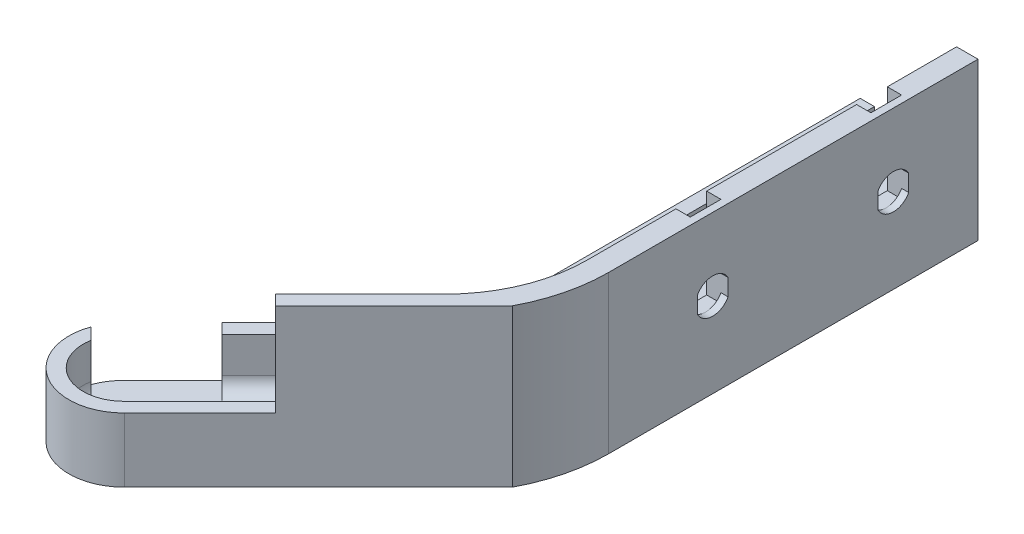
ISO-10303-21;
HEADER;
FILE_DESCRIPTION(('STEP AP214'),'2;1');
FILE_NAME('part.step','',(''),(''),'','','');
FILE_SCHEMA(('AUTOMOTIVE_DESIGN { 1 0 10303 214 1 1 1 1 }'));
ENDSEC;
DATA;
#1=APPLICATION_CONTEXT('core data for automotive mechanical design processes');
#2=APPLICATION_PROTOCOL_DEFINITION('international standard','automotive_design',2000,#1);
#3=PRODUCT_CONTEXT('',#1,'mechanical');
#4=PRODUCT('Part','Part','',(#3));
#5=PRODUCT_RELATED_PRODUCT_CATEGORY('part','',(#4));
#6=PRODUCT_DEFINITION_FORMATION('','',#4);
#7=PRODUCT_DEFINITION_CONTEXT('part definition',#1,'design');
#8=PRODUCT_DEFINITION('design','',#6,#7);
#9=PRODUCT_DEFINITION_SHAPE('','',#8);
#10=(LENGTH_UNIT() NAMED_UNIT(*) SI_UNIT(.MILLI.,.METRE.));
#11=(NAMED_UNIT(*) PLANE_ANGLE_UNIT() SI_UNIT($,.RADIAN.));
#12=(NAMED_UNIT(*) SI_UNIT($,.STERADIAN.) SOLID_ANGLE_UNIT());
#13=UNCERTAINTY_MEASURE_WITH_UNIT(LENGTH_MEASURE(1.E-05),#10,'distance_accuracy_value','');
#14=(GEOMETRIC_REPRESENTATION_CONTEXT(3) GLOBAL_UNCERTAINTY_ASSIGNED_CONTEXT((#13)) GLOBAL_UNIT_ASSIGNED_CONTEXT((#10,
#11,#12)) REPRESENTATION_CONTEXT('',''));
#15=CARTESIAN_POINT('',(0.,0.,0.));
#16=DIRECTION('',(0.,0.,1.));
#17=DIRECTION('',(1.,0.,0.));
#18=AXIS2_PLACEMENT_3D('',#15,#16,#17);
#19=CARTESIAN_POINT('',(31.2852712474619,9.85000000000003,-76.4342712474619));
#20=DIRECTION('',(-1.,0.,0.));
#21=DIRECTION('',(0.,0.,1.));
#22=AXIS2_PLACEMENT_3D('',#19,#20,#21);
#23=CYLINDRICAL_SURFACE('',#22,2.45);
#24=CARTESIAN_POINT('',(30.2842712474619,9.85000000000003,-76.4342712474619));
#25=DIRECTION('',(-1.,0.,0.));
#26=DIRECTION('',(0.,0.,1.));
#27=AXIS2_PLACEMENT_3D('',#24,#25,#26);
#28=CIRCLE('',#27,2.45);
#29=CARTESIAN_POINT('',(30.2842712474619,7.40000000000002,-76.4342712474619));
#30=VERTEX_POINT('',#29);
#31=CARTESIAN_POINT('',(30.2842712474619,8.67526598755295,-74.2842712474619));
#32=VERTEX_POINT('',#31);
#33=EDGE_CURVE('E350',#30,#32,#28,.T.);
#34=ORIENTED_EDGE('',*,*,#33,.T.);
#35=DIRECTION('',(-1.,0.,0.));
#36=VECTOR('',#35,1.);
#37=CARTESIAN_POINT('',(31.2852712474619,8.67526598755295,-74.2842712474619));
#38=LINE('',#37,#36);
#39=CARTESIAN_POINT('',(31.2842712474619,8.67526598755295,-74.2842712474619));
#40=VERTEX_POINT('',#39);
#41=EDGE_CURVE('E465',#40,#32,#38,.T.);
#42=ORIENTED_EDGE('',*,*,#41,.F.);
#43=CARTESIAN_POINT('',(31.2842712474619,9.85000000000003,-76.4342712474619));
#44=DIRECTION('',(-1.,0.,0.));
#45=DIRECTION('',(0.,0.,1.));
#46=AXIS2_PLACEMENT_3D('',#43,#44,#45);
#47=CIRCLE('',#46,2.45);
#48=CARTESIAN_POINT('',(31.2842712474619,8.67526598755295,-78.5842712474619));
#49=VERTEX_POINT('',#48);
#50=EDGE_CURVE('E459',#40,#49,#47,.F.);
#51=ORIENTED_EDGE('',*,*,#50,.T.);
#52=DIRECTION('',(-1.,0.,0.));
#53=VECTOR('',#52,1.);
#54=CARTESIAN_POINT('',(31.2852712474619,8.67526598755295,-78.5842712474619));
#55=LINE('',#54,#53);
#56=CARTESIAN_POINT('',(30.2842712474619,8.67526598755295,-78.5842712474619));
#57=VERTEX_POINT('',#56);
#58=EDGE_CURVE('E468',#49,#57,#55,.T.);
#59=ORIENTED_EDGE('',*,*,#58,.T.);
#60=CARTESIAN_POINT('',(30.2842712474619,9.85000000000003,-76.4342712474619));
#61=DIRECTION('',(-1.,0.,0.));
#62=DIRECTION('',(0.,0.,1.));
#63=AXIS2_PLACEMENT_3D('',#60,#61,#62);
#64=CIRCLE('',#63,2.45);
#65=EDGE_CURVE('E349',#57,#30,#64,.T.);
#66=ORIENTED_EDGE('',*,*,#65,.T.);
#67=EDGE_LOOP('',(#34,#42,#51,#59,#66));
#68=FACE_BOUND('',#67,.T.);
#69=ADVANCED_FACE('F54',(#68),#23,.F.);
#70=CARTESIAN_POINT('',(31.2852712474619,9.85000000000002,-51.1342712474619));
#71=DIRECTION('',(-1.,0.,0.));
#72=DIRECTION('',(0.,0.,1.));
#73=AXIS2_PLACEMENT_3D('',#70,#71,#72);
#74=CYLINDRICAL_SURFACE('',#73,2.44999999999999);
#75=CARTESIAN_POINT('',(30.2842712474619,9.85000000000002,-51.1342712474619));
#76=DIRECTION('',(-1.,0.,0.));
#77=DIRECTION('',(0.,0.,1.));
#78=AXIS2_PLACEMENT_3D('',#75,#76,#77);
#79=CIRCLE('',#78,2.44999999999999);
#80=CARTESIAN_POINT('',(30.2842712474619,8.67526598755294,-53.2842712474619));
#81=VERTEX_POINT('',#80);
#82=CARTESIAN_POINT('',(30.2842712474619,7.40000000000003,-51.1342712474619));
#83=VERTEX_POINT('',#82);
#84=EDGE_CURVE('E378',#81,#83,#79,.T.);
#85=ORIENTED_EDGE('',*,*,#84,.T.);
#86=CARTESIAN_POINT('',(30.2842712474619,9.85000000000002,-51.1342712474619));
#87=DIRECTION('',(-1.,0.,0.));
#88=DIRECTION('',(0.,0.,1.));
#89=AXIS2_PLACEMENT_3D('',#86,#87,#88);
#90=CIRCLE('',#89,2.44999999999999);
#91=CARTESIAN_POINT('',(30.2842712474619,8.67526598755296,-48.9842712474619));
#92=VERTEX_POINT('',#91);
#93=EDGE_CURVE('E386',#83,#92,#90,.T.);
#94=ORIENTED_EDGE('',*,*,#93,.T.);
#95=DIRECTION('',(-1.,0.,0.));
#96=VECTOR('',#95,1.);
#97=CARTESIAN_POINT('',(31.2852712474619,8.67526598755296,-48.9842712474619));
#98=LINE('',#97,#96);
#99=CARTESIAN_POINT('',(31.2842712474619,8.67526598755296,-48.9842712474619));
#100=VERTEX_POINT('',#99);
#101=EDGE_CURVE('E443',#100,#92,#98,.T.);
#102=ORIENTED_EDGE('',*,*,#101,.F.);
#103=CARTESIAN_POINT('',(31.2842712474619,9.85000000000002,-51.1342712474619));
#104=DIRECTION('',(-1.,0.,0.));
#105=DIRECTION('',(0.,0.,1.));
#106=AXIS2_PLACEMENT_3D('',#103,#104,#105);
#107=CIRCLE('',#106,2.44999999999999);
#108=CARTESIAN_POINT('',(31.2842712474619,8.67526598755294,-53.2842712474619));
#109=VERTEX_POINT('',#108);
#110=EDGE_CURVE('E432',#100,#109,#107,.F.);
#111=ORIENTED_EDGE('',*,*,#110,.T.);
#112=DIRECTION('',(-1.,0.,0.));
#113=VECTOR('',#112,1.);
#114=CARTESIAN_POINT('',(31.2852712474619,8.67526598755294,-53.2842712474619));
#115=LINE('',#114,#113);
#116=EDGE_CURVE('E447',#109,#81,#115,.T.);
#117=ORIENTED_EDGE('',*,*,#116,.T.);
#118=EDGE_LOOP('',(#85,#94,#102,#111,#117));
#119=FACE_BOUND('',#118,.T.);
#120=ADVANCED_FACE('F681',(#119),#74,.F.);
#121=CARTESIAN_POINT('',(31.2852712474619,9.85000000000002,-51.1342712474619));
#122=DIRECTION('',(-1.,0.,0.));
#123=DIRECTION('',(0.,0.,1.));
#124=AXIS2_PLACEMENT_3D('',#121,#122,#123);
#125=CYLINDRICAL_SURFACE('',#124,2.44999999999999);
#126=CARTESIAN_POINT('',(30.2842712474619,9.85000000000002,-51.1342712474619));
#127=DIRECTION('',(-1.,0.,0.));
#128=DIRECTION('',(0.,0.,1.));
#129=AXIS2_PLACEMENT_3D('',#126,#127,#128);
#130=CIRCLE('',#129,2.44999999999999);
#131=CARTESIAN_POINT('',(30.2842712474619,11.0247340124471,-48.9842712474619));
#132=VERTEX_POINT('',#131);
#133=CARTESIAN_POINT('',(30.2842712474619,11.0247340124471,-53.2842712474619));
#134=VERTEX_POINT('',#133);
#135=EDGE_CURVE('E399',#132,#134,#130,.T.);
#136=ORIENTED_EDGE('',*,*,#135,.T.);
#137=DIRECTION('',(-1.,0.,0.));
#138=VECTOR('',#137,1.);
#139=CARTESIAN_POINT('',(31.2852712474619,11.0247340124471,-53.2842712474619));
#140=LINE('',#139,#138);
#141=CARTESIAN_POINT('',(31.2842712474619,11.0247340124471,-53.2842712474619));
#142=VERTEX_POINT('',#141);
#143=EDGE_CURVE('E450',#142,#134,#140,.T.);
#144=ORIENTED_EDGE('',*,*,#143,.F.);
#145=CARTESIAN_POINT('',(31.2842712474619,9.85000000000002,-51.1342712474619));
#146=DIRECTION('',(-1.,0.,0.));
#147=DIRECTION('',(0.,0.,1.));
#148=AXIS2_PLACEMENT_3D('',#145,#146,#147);
#149=CIRCLE('',#148,2.44999999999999);
#150=CARTESIAN_POINT('',(31.2842712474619,11.0247340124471,-48.9842712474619));
#151=VERTEX_POINT('',#150);
#152=EDGE_CURVE('E446',#142,#151,#149,.F.);
#153=ORIENTED_EDGE('',*,*,#152,.T.);
#154=DIRECTION('',(-1.,0.,0.));
#155=VECTOR('',#154,1.);
#156=CARTESIAN_POINT('',(31.2852712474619,11.0247340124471,-48.9842712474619));
#157=LINE('',#156,#155);
#158=EDGE_CURVE('E442',#151,#132,#157,.T.);
#159=ORIENTED_EDGE('',*,*,#158,.T.);
#160=EDGE_LOOP('',(#136,#144,#153,#159));
#161=FACE_BOUND('',#160,.T.);
#162=ADVANCED_FACE('F687',(#161),#125,.F.);
#163=CARTESIAN_POINT('',(31.2852712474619,9.85000000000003,-76.4342712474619));
#164=DIRECTION('',(-1.,0.,0.));
#165=DIRECTION('',(0.,0.,1.));
#166=AXIS2_PLACEMENT_3D('',#163,#164,#165);
#167=CYLINDRICAL_SURFACE('',#166,2.45);
#168=CARTESIAN_POINT('',(30.2842712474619,9.85000000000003,-76.4342712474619));
#169=DIRECTION('',(-1.,0.,0.));
#170=DIRECTION('',(0.,0.,1.));
#171=AXIS2_PLACEMENT_3D('',#168,#169,#170);
#172=CIRCLE('',#171,2.45);
#173=CARTESIAN_POINT('',(30.2842712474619,11.0247340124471,-74.2842712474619));
#174=VERTEX_POINT('',#173);
#175=CARTESIAN_POINT('',(30.2842712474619,11.0247340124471,-78.5842712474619));
#176=VERTEX_POINT('',#175);
#177=EDGE_CURVE('E413',#174,#176,#172,.T.);
#178=ORIENTED_EDGE('',*,*,#177,.T.);
#179=DIRECTION('',(-1.,0.,0.));
#180=VECTOR('',#179,1.);
#181=CARTESIAN_POINT('',(31.2852712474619,11.0247340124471,-78.5842712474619));
#182=LINE('',#181,#180);
#183=CARTESIAN_POINT('',(31.2842712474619,11.0247340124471,-78.5842712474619));
#184=VERTEX_POINT('',#183);
#185=EDGE_CURVE('E471',#184,#176,#182,.T.);
#186=ORIENTED_EDGE('',*,*,#185,.F.);
#187=CARTESIAN_POINT('',(31.2842712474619,9.85000000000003,-76.4342712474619));
#188=DIRECTION('',(-1.,0.,0.));
#189=DIRECTION('',(0.,0.,1.));
#190=AXIS2_PLACEMENT_3D('',#187,#188,#189);
#191=CIRCLE('',#190,2.45);
#192=CARTESIAN_POINT('',(31.2842712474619,11.0247340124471,-74.2842712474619));
#193=VERTEX_POINT('',#192);
#194=EDGE_CURVE('E467',#184,#193,#191,.F.);
#195=ORIENTED_EDGE('',*,*,#194,.T.);
#196=DIRECTION('',(-1.,0.,0.));
#197=VECTOR('',#196,1.);
#198=CARTESIAN_POINT('',(31.2852712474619,11.0247340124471,-74.2842712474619));
#199=LINE('',#198,#197);
#200=EDGE_CURVE('E464',#193,#174,#199,.T.);
#201=ORIENTED_EDGE('',*,*,#200,.T.);
#202=EDGE_LOOP('',(#178,#186,#195,#201));
#203=FACE_BOUND('',#202,.T.);
#204=ADVANCED_FACE('F698',(#203),#167,.F.);
#205=CARTESIAN_POINT('',(-4.06586399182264,7.,-4.06586399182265));
#206=DIRECTION('',(0.,1.,0.));
#207=DIRECTION('',(0.,0.,1.));
#208=AXIS2_PLACEMENT_3D('',#205,#206,#207);
#209=PLANE('',#208);
#210=DIRECTION('',(-0.707106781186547,0.,-0.707106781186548));
#211=VECTOR('',#210,1.);
#212=CARTESIAN_POINT('',(6.86030437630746,7.,-6.86030437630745));
#213=LINE('',#212,#211);
#214=CARTESIAN_POINT('',(-1.27142360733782,7.,-14.9920323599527));
#215=VERTEX_POINT('',#214);
#216=CARTESIAN_POINT('',(-2.68563716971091,7.,-16.4062459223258));
#217=VERTEX_POINT('',#216);
#218=EDGE_CURVE('E491',#215,#217,#213,.T.);
#219=ORIENTED_EDGE('',*,*,#218,.F.);
#220=DIRECTION('',(0.707106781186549,0.,-0.707106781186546));
#221=VECTOR('',#220,1.);
#222=CARTESIAN_POINT('',(-8.13172798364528,7.,-8.1317279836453));
#223=LINE('',#222,#221);
#224=CARTESIAN_POINT('',(15.3198051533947,7.,-31.5832611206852));
#225=VERTEX_POINT('',#224);
#226=EDGE_CURVE('E511',#215,#225,#223,.T.);
#227=ORIENTED_EDGE('',*,*,#226,.T.);
#228=CARTESIAN_POINT('',(11.784271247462,7.,-35.1187950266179));
#229=DIRECTION('',(0.,1.,0.));
#230=DIRECTION('',(0.,0.,1.));
#231=AXIS2_PLACEMENT_3D('',#228,#229,#230);
#232=CIRCLE('',#231,5.);
#233=CARTESIAN_POINT('',(16.784271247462,7.,-35.1187950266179));
#234=VERTEX_POINT('',#233);
#235=EDGE_CURVE('E513',#225,#234,#232,.T.);
#236=ORIENTED_EDGE('',*,*,#235,.T.);
#237=DIRECTION('',(0.,0.,-1.));
#238=VECTOR('',#237,1.);
#239=CARTESIAN_POINT('',(16.784271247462,7.,-35.1187950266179));
#240=LINE('',#239,#238);
#241=CARTESIAN_POINT('',(16.7842712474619,7.,-88.2842712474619));
#242=VERTEX_POINT('',#241);
#243=EDGE_CURVE('E516',#234,#242,#240,.T.);
#244=ORIENTED_EDGE('',*,*,#243,.T.);
#245=DIRECTION('',(-1.,0.,0.));
#246=VECTOR('',#245,1.);
#247=CARTESIAN_POINT('',(16.7842712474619,7.,-88.2842712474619));
#248=LINE('',#247,#246);
#249=CARTESIAN_POINT('',(14.7842712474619,7.,-88.2842712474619));
#250=VERTEX_POINT('',#249);
#251=EDGE_CURVE('E518',#242,#250,#248,.T.);
#252=ORIENTED_EDGE('',*,*,#251,.T.);
#253=DIRECTION('',(0.,0.,1.));
#254=VECTOR('',#253,1.);
#255=CARTESIAN_POINT('',(14.7842712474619,7.,-88.2842712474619));
#256=LINE('',#255,#254);
#257=CARTESIAN_POINT('',(14.784271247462,7.,-35.1187950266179));
#258=VERTEX_POINT('',#257);
#259=EDGE_CURVE('E520',#250,#258,#256,.T.);
#260=ORIENTED_EDGE('',*,*,#259,.T.);
#261=CARTESIAN_POINT('',(11.784271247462,7.,-35.1187950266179));
#262=DIRECTION('',(0.,-1.,0.));
#263=DIRECTION('',(0.,0.,1.));
#264=AXIS2_PLACEMENT_3D('',#261,#262,#263);
#265=CIRCLE('',#264,3.);
#266=CARTESIAN_POINT('',(13.9055915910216,7.,-32.9974746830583));
#267=VERTEX_POINT('',#266);
#268=EDGE_CURVE('E522',#258,#267,#265,.T.);
#269=ORIENTED_EDGE('',*,*,#268,.T.);
#270=DIRECTION('',(-0.707106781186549,0.,0.707106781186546));
#271=VECTOR('',#270,1.);
#272=CARTESIAN_POINT('',(13.9055915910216,7.,-32.9974746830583));
#273=LINE('',#272,#271);
#274=EDGE_CURVE('E524',#267,#217,#273,.T.);
#275=ORIENTED_EDGE('',*,*,#274,.T.);
#276=EDGE_LOOP('',(#219,#227,#236,#244,#252,#260,#269,#275));
#277=FACE_BOUND('',#276,.T.);
#278=ADVANCED_FACE('F701',(#277),#209,.T.);
#279=CARTESIAN_POINT('',(14.7842712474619,20.,-88.2842712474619));
#280=DIRECTION('',(1.,0.,0.));
#281=DIRECTION('',(0.,0.,-1.));
#282=AXIS2_PLACEMENT_3D('',#279,#280,#281);
#283=PLANE('',#282);
#284=ORIENTED_EDGE('',*,*,#259,.F.);
#285=DIRECTION('',(0.,-1.,0.));
#286=VECTOR('',#285,1.);
#287=CARTESIAN_POINT('',(14.7842712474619,20.,-88.2842712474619));
#288=LINE('',#287,#286);
#289=CARTESIAN_POINT('',(14.7842712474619,-2.,-88.2842712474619));
#290=VERTEX_POINT('',#289);
#291=EDGE_CURVE('E571',#250,#290,#288,.T.);
#292=ORIENTED_EDGE('',*,*,#291,.T.);
#293=DIRECTION('',(0.,0.,1.));
#294=VECTOR('',#293,1.);
#295=CARTESIAN_POINT('',(14.7842712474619,-2.,-88.2842712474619));
#296=LINE('',#295,#294);
#297=CARTESIAN_POINT('',(14.784271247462,-2.,-35.1187950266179));
#298=VERTEX_POINT('',#297);
#299=EDGE_CURVE('E567',#290,#298,#296,.T.);
#300=ORIENTED_EDGE('',*,*,#299,.T.);
#301=DIRECTION('',(0.,1.,0.));
#302=VECTOR('',#301,1.);
#303=CARTESIAN_POINT('',(14.784271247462,20.,-35.1187950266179));
#304=LINE('',#303,#302);
#305=EDGE_CURVE('E576',#298,#258,#304,.T.);
#306=ORIENTED_EDGE('',*,*,#305,.T.);
#307=EDGE_LOOP('',(#284,#292,#300,#306));
#308=FACE_BOUND('',#307,.T.);
#309=ADVANCED_FACE('F830',(#308),#283,.F.);
#310=CARTESIAN_POINT('',(15.3700576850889,20.,-34.4619407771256));
#311=DIRECTION('',(0.707106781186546,0.,0.707106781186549));
#312=DIRECTION('',(0.707106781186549,0.,-0.707106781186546));
#313=AXIS2_PLACEMENT_3D('',#310,#311,#312);
#314=PLANE('',#313);
#315=DIRECTION('',(0.707106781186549,0.,-0.707106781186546));
#316=VECTOR('',#315,1.);
#317=CARTESIAN_POINT('',(-9.54594154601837,0.,-9.5459415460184));
#318=LINE('',#317,#316);
#319=CARTESIAN_POINT('',(-9.54594154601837,0.,-9.5459415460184));
#320=VERTEX_POINT('',#319);
#321=CARTESIAN_POINT('',(-2.68563716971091,0.,-16.4062459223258));
#322=VERTEX_POINT('',#321);
#323=EDGE_CURVE('E481',#320,#322,#318,.T.);
#324=ORIENTED_EDGE('',*,*,#323,.T.);
#325=DIRECTION('',(0.,1.,0.));
#326=VECTOR('',#325,1.);
#327=CARTESIAN_POINT('',(-2.68563716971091,-15.1775671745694,-16.4062459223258));
#328=LINE('',#327,#326);
#329=EDGE_CURVE('E482',#322,#217,#328,.T.);
#330=ORIENTED_EDGE('',*,*,#329,.T.);
#331=ORIENTED_EDGE('',*,*,#274,.F.);
#332=DIRECTION('',(0.,1.,0.));
#333=VECTOR('',#332,1.);
#334=CARTESIAN_POINT('',(13.9055915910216,20.,-32.9974746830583));
#335=LINE('',#334,#333);
#336=CARTESIAN_POINT('',(13.9055915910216,-2.,-32.9974746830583));
#337=VERTEX_POINT('',#336);
#338=EDGE_CURVE('E580',#267,#337,#335,.F.);
#339=ORIENTED_EDGE('',*,*,#338,.T.);
#340=DIRECTION('',(-0.707106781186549,0.,0.707106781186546));
#341=VECTOR('',#340,1.);
#342=CARTESIAN_POINT('',(15.3700576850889,-2.,-34.4619407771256));
#343=LINE('',#342,#341);
#344=CARTESIAN_POINT('',(-9.54594154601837,-2.,-9.54594154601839));
#345=VERTEX_POINT('',#344);
#346=EDGE_CURVE('E575',#337,#345,#343,.T.);
#347=ORIENTED_EDGE('',*,*,#346,.T.);
#348=DIRECTION('',(0.,-1.,0.));
#349=VECTOR('',#348,1.);
#350=CARTESIAN_POINT('',(-9.54594154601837,20.,-9.54594154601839));
#351=LINE('',#350,#349);
#352=EDGE_CURVE('E598',#320,#345,#351,.T.);
#353=ORIENTED_EDGE('',*,*,#352,.F.);
#354=EDGE_LOOP('',(#324,#330,#331,#339,#347,#353));
#355=FACE_BOUND('',#354,.T.);
#356=ADVANCED_FACE('F839',(#355),#314,.F.);
#357=CARTESIAN_POINT('',(-4.06586399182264,20.,-4.06586399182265));
#358=DIRECTION('',(0.,-1.,0.));
#359=DIRECTION('',(0.,0.,-1.));
#360=AXIS2_PLACEMENT_3D('',#357,#358,#359);
#361=CYLINDRICAL_SURFACE('',#360,7.74999999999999);
#362=CARTESIAN_POINT('',(-4.06586399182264,7.,-4.06586399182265));
#363=DIRECTION('',(0.,1.,0.));
#364=DIRECTION('',(0.,0.,1.));
#365=AXIS2_PLACEMENT_3D('',#362,#363,#364);
#366=CIRCLE('',#365,7.74999999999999);
#367=CARTESIAN_POINT('',(-11.3570439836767,7.,-6.69287642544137));
#368=VERTEX_POINT('',#367);
#369=CARTESIAN_POINT('',(1.41421356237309,7.,1.4142135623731));
#370=VERTEX_POINT('',#369);
#371=EDGE_CURVE('E527',#368,#370,#366,.T.);
#372=ORIENTED_EDGE('',*,*,#371,.F.);
#373=DIRECTION('',(0.,1.,0.));
#374=VECTOR('',#373,1.);
#375=CARTESIAN_POINT('',(-11.3570439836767,-15.1775671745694,-6.69287642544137));
#376=LINE('',#375,#374);
#377=CARTESIAN_POINT('',(-11.3570439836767,0.,-6.69287642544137));
#378=VERTEX_POINT('',#377);
#379=EDGE_CURVE('E493',#378,#368,#376,.T.);
#380=ORIENTED_EDGE('',*,*,#379,.F.);
#381=CARTESIAN_POINT('',(-4.06586399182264,0.,-4.06586399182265));
#382=DIRECTION('',(0.,1.,0.));
#383=DIRECTION('',(0.,0.,1.));
#384=AXIS2_PLACEMENT_3D('',#381,#382,#383);
#385=CIRCLE('',#384,7.74999999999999);
#386=EDGE_CURVE('E485',#378,#320,#385,.F.);
#387=ORIENTED_EDGE('',*,*,#386,.T.);
#388=ORIENTED_EDGE('',*,*,#352,.T.);
#389=CARTESIAN_POINT('',(-4.06586399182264,-2.,-4.06586399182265));
#390=DIRECTION('',(0.,1.,0.));
#391=DIRECTION('',(0.,0.,1.));
#392=AXIS2_PLACEMENT_3D('',#389,#390,#391);
#393=CIRCLE('',#392,7.74999999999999);
#394=CARTESIAN_POINT('',(1.41421356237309,-2.,1.4142135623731));
#395=VERTEX_POINT('',#394);
#396=EDGE_CURVE('E591',#345,#395,#393,.T.);
#397=ORIENTED_EDGE('',*,*,#396,.T.);
#398=DIRECTION('',(0.,1.,0.));
#399=VECTOR('',#398,1.);
#400=CARTESIAN_POINT('',(1.41421356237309,20.,1.4142135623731));
#401=LINE('',#400,#399);
#402=EDGE_CURVE('E600',#370,#395,#401,.F.);
#403=ORIENTED_EDGE('',*,*,#402,.F.);
#404=EDGE_LOOP('',(#372,#380,#387,#388,#397,#403));
#405=FACE_BOUND('',#404,.T.);
#406=ADVANCED_FACE('F845',(#405),#361,.T.);
#407=CARTESIAN_POINT('',(28.2842712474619,20.,-88.2842712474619));
#408=DIRECTION('',(0.,0.,1.));
#409=DIRECTION('',(1.,0.,0.));
#410=AXIS2_PLACEMENT_3D('',#407,#408,#409);
#411=PLANE('',#410);
#412=ORIENTED_EDGE('',*,*,#251,.F.);
#413=DIRECTION('',(0.,-1.,0.));
#414=VECTOR('',#413,1.);
#415=CARTESIAN_POINT('',(16.7842712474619,20.,-88.2842712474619));
#416=LINE('',#415,#414);
#417=CARTESIAN_POINT('',(16.7842712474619,2.,-88.2842712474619));
#418=VERTEX_POINT('',#417);
#419=EDGE_CURVE('E546',#242,#418,#416,.T.);
#420=ORIENTED_EDGE('',*,*,#419,.T.);
#421=CARTESIAN_POINT('',(18.7842712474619,2.,-88.2842712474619));
#422=DIRECTION('',(0.,0.,1.));
#423=DIRECTION('',(1.,0.,0.));
#424=AXIS2_PLACEMENT_3D('',#421,#422,#423);
#425=CIRCLE('',#424,2.);
#426=CARTESIAN_POINT('',(18.7842712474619,0.,-88.2842712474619));
#427=VERTEX_POINT('',#426);
#428=EDGE_CURVE('E63',#418,#427,#425,.T.);
#429=ORIENTED_EDGE('',*,*,#428,.T.);
#430=DIRECTION('',(-1.,0.,0.));
#431=VECTOR('',#430,1.);
#432=CARTESIAN_POINT('',(28.2842712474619,0.,-88.2842712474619));
#433=LINE('',#432,#431);
#434=CARTESIAN_POINT('',(26.2842712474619,0.,-88.2842712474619));
#435=VERTEX_POINT('',#434);
#436=EDGE_CURVE('E536',#435,#427,#433,.T.);
#437=ORIENTED_EDGE('',*,*,#436,.F.);
#438=CARTESIAN_POINT('',(26.2842712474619,2.,-88.2842712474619));
#439=DIRECTION('',(0.,0.,1.));
#440=DIRECTION('',(1.,0.,0.));
#441=AXIS2_PLACEMENT_3D('',#438,#439,#440);
#442=CIRCLE('',#441,2.);
#443=CARTESIAN_POINT('',(28.2842712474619,2.,-88.2842712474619));
#444=VERTEX_POINT('',#443);
#445=EDGE_CURVE('E12',#435,#444,#442,.T.);
#446=ORIENTED_EDGE('',*,*,#445,.T.);
#447=DIRECTION('',(0.,-1.,0.));
#448=VECTOR('',#447,1.);
#449=CARTESIAN_POINT('',(28.2842712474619,20.,-88.2842712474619));
#450=LINE('',#449,#448);
#451=CARTESIAN_POINT('',(28.2842712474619,20.,-88.2842712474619));
#452=VERTEX_POINT('',#451);
#453=EDGE_CURVE('E550',#452,#444,#450,.T.);
#454=ORIENTED_EDGE('',*,*,#453,.F.);
#455=DIRECTION('',(-1.,0.,0.));
#456=VECTOR('',#455,1.);
#457=CARTESIAN_POINT('',(28.2842712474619,20.,-88.2842712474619));
#458=LINE('',#457,#456);
#459=CARTESIAN_POINT('',(31.2842712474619,20.,-88.2842712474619));
#460=VERTEX_POINT('',#459);
#461=EDGE_CURVE('E568',#460,#452,#458,.T.);
#462=ORIENTED_EDGE('',*,*,#461,.F.);
#463=DIRECTION('',(0.,-1.,0.));
#464=VECTOR('',#463,1.);
#465=CARTESIAN_POINT('',(31.2842712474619,20.,-88.2842712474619));
#466=LINE('',#465,#464);
#467=CARTESIAN_POINT('',(31.2842712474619,-2.,-88.2842712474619));
#468=VERTEX_POINT('',#467);
#469=EDGE_CURVE('E602',#460,#468,#466,.T.);
#470=ORIENTED_EDGE('',*,*,#469,.T.);
#471=DIRECTION('',(-1.,0.,0.));
#472=VECTOR('',#471,1.);
#473=CARTESIAN_POINT('',(28.2842712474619,-2.,-88.2842712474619));
#474=LINE('',#473,#472);
#475=EDGE_CURVE('E583',#468,#290,#474,.T.);
#476=ORIENTED_EDGE('',*,*,#475,.T.);
#477=ORIENTED_EDGE('',*,*,#291,.F.);
#478=EDGE_LOOP('',(#412,#420,#429,#437,#446,#454,#462,#470,#476,#477));
#479=FACE_BOUND('',#478,.T.);
#480=ADVANCED_FACE('F813',(#479),#411,.F.);
#481=CARTESIAN_POINT('',(11.784271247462,20.,-35.1187950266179));
#482=DIRECTION('',(0.,1.,0.));
#483=DIRECTION('',(0.,0.,1.));
#484=AXIS2_PLACEMENT_3D('',#481,#482,#483);
#485=CYLINDRICAL_SURFACE('',#484,3.);
#486=ORIENTED_EDGE('',*,*,#268,.F.);
#487=ORIENTED_EDGE('',*,*,#305,.F.);
#488=CARTESIAN_POINT('',(11.784271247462,-2.,-35.1187950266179));
#489=DIRECTION('',(0.,1.,0.));
#490=DIRECTION('',(0.,0.,1.));
#491=AXIS2_PLACEMENT_3D('',#488,#489,#490);
#492=CIRCLE('',#491,3.);
#493=EDGE_CURVE('E579',#337,#298,#492,.T.);
#494=ORIENTED_EDGE('',*,*,#493,.F.);
#495=ORIENTED_EDGE('',*,*,#338,.F.);
#496=EDGE_LOOP('',(#486,#487,#494,#495));
#497=FACE_BOUND('',#496,.T.);
#498=ADVANCED_FACE('F833',(#497),#485,.F.);
#499=CARTESIAN_POINT('',(16.7842712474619,20.,-88.2842712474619));
#500=DIRECTION('',(1.,0.,0.));
#501=DIRECTION('',(0.,0.,-1.));
#502=AXIS2_PLACEMENT_3D('',#499,#500,#501);
#503=PLANE('',#502);
#504=DIRECTION('',(0.,-1.,0.));
#505=VECTOR('',#504,1.);
#506=CARTESIAN_POINT('',(16.784271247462,20.,-35.1187950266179));
#507=LINE('',#506,#505);
#508=CARTESIAN_POINT('',(16.784271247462,2.,-35.1187950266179));
#509=VERTEX_POINT('',#508);
#510=EDGE_CURVE('E558',#509,#234,#507,.F.);
#511=ORIENTED_EDGE('',*,*,#510,.F.);
#512=DIRECTION('',(0.,0.,1.));
#513=VECTOR('',#512,1.);
#514=CARTESIAN_POINT('',(16.7842712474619,2.,-88.2842712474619));
#515=LINE('',#514,#513);
#516=EDGE_CURVE('E77',#509,#418,#515,.F.);
#517=ORIENTED_EDGE('',*,*,#516,.T.);
#518=ORIENTED_EDGE('',*,*,#419,.F.);
#519=ORIENTED_EDGE('',*,*,#243,.F.);
#520=EDGE_LOOP('',(#511,#517,#518,#519));
#521=FACE_BOUND('',#520,.T.);
#522=ADVANCED_FACE('F893',(#521),#503,.T.);
#523=CARTESIAN_POINT('',(16.784271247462,20.,-33.0477272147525));
#524=DIRECTION('',(0.707106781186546,0.,0.707106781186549));
#525=DIRECTION('',(0.707106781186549,0.,-0.707106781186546));
#526=AXIS2_PLACEMENT_3D('',#523,#524,#525);
#527=PLANE('',#526);
#528=DIRECTION('',(0.,1.,0.));
#529=VECTOR('',#528,1.);
#530=CARTESIAN_POINT('',(-1.27142360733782,-15.1775671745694,-14.9920323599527));
#531=LINE('',#530,#529);
#532=CARTESIAN_POINT('',(-1.27142360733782,2.,-14.9920323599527));
#533=VERTEX_POINT('',#532);
#534=EDGE_CURVE('E496',#533,#215,#531,.T.);
#535=ORIENTED_EDGE('',*,*,#534,.F.);
#536=DIRECTION('',(-0.707106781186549,0.,0.707106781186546));
#537=VECTOR('',#536,1.);
#538=CARTESIAN_POINT('',(15.3198051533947,2.,-31.5832611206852));
#539=LINE('',#538,#537);
#540=CARTESIAN_POINT('',(15.3198051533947,2.,-31.5832611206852));
#541=VERTEX_POINT('',#540);
#542=EDGE_CURVE('E633',#533,#541,#539,.F.);
#543=ORIENTED_EDGE('',*,*,#542,.T.);
#544=DIRECTION('',(0.,-1.,0.));
#545=VECTOR('',#544,1.);
#546=CARTESIAN_POINT('',(15.3198051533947,0.,-31.5832611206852));
#547=LINE('',#546,#545);
#548=EDGE_CURVE('E555',#225,#541,#547,.T.);
#549=ORIENTED_EDGE('',*,*,#548,.F.);
#550=ORIENTED_EDGE('',*,*,#226,.F.);
#551=EDGE_LOOP('',(#535,#543,#549,#550));
#552=FACE_BOUND('',#551,.T.);
#553=ADVANCED_FACE('F900',(#552),#527,.T.);
#554=CARTESIAN_POINT('',(-4.06586399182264,20.,-4.06586399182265));
#555=DIRECTION('',(0.,-1.,0.));
#556=DIRECTION('',(0.,0.,-1.));
#557=AXIS2_PLACEMENT_3D('',#554,#555,#556);
#558=CYLINDRICAL_SURFACE('',#557,5.74999999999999);
#559=DIRECTION('',(0.,-1.,0.));
#560=VECTOR('',#559,1.);
#561=CARTESIAN_POINT('',(0.,20.,0.));
#562=LINE('',#561,#560);
#563=CARTESIAN_POINT('',(0.,7.,0.));
#564=VERTEX_POINT('',#563);
#565=CARTESIAN_POINT('',(0.,2.,0.));
#566=VERTEX_POINT('',#565);
#567=EDGE_CURVE('E552',#564,#566,#562,.T.);
#568=ORIENTED_EDGE('',*,*,#567,.T.);
#569=CARTESIAN_POINT('',(-4.06586399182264,2.,-4.06586399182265));
#570=DIRECTION('',(0.,1.,0.));
#571=DIRECTION('',(0.,0.,1.));
#572=AXIS2_PLACEMENT_3D('',#569,#570,#571);
#573=CIRCLE('',#572,5.74999999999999);
#574=CARTESIAN_POINT('',(-9.72850857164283,2.,-5.06434101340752));
#575=VERTEX_POINT('',#574);
#576=EDGE_CURVE('E637',#566,#575,#573,.F.);
#577=ORIENTED_EDGE('',*,*,#576,.T.);
#578=DIRECTION('',(0.,1.,0.));
#579=VECTOR('',#578,1.);
#580=CARTESIAN_POINT('',(-9.72850857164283,-15.1775671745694,-5.06434101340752));
#581=LINE('',#580,#579);
#582=CARTESIAN_POINT('',(-9.72850857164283,7.,-5.06434101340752));
#583=VERTEX_POINT('',#582);
#584=EDGE_CURVE('E498',#575,#583,#581,.T.);
#585=ORIENTED_EDGE('',*,*,#584,.T.);
#586=CARTESIAN_POINT('',(-4.06586399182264,7.,-4.06586399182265));
#587=DIRECTION('',(0.,-1.,0.));
#588=DIRECTION('',(0.,0.,1.));
#589=AXIS2_PLACEMENT_3D('',#586,#587,#588);
#590=CIRCLE('',#589,5.75);
#591=EDGE_CURVE('E508',#564,#583,#590,.T.);
#592=ORIENTED_EDGE('',*,*,#591,.F.);
#593=EDGE_LOOP('',(#568,#577,#585,#592));
#594=FACE_BOUND('',#593,.T.);
#595=ADVANCED_FACE('F854',(#594),#558,.F.);
#596=CARTESIAN_POINT('',(11.784271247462,20.,-35.1187950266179));
#597=DIRECTION('',(0.,1.,0.));
#598=DIRECTION('',(0.,0.,1.));
#599=AXIS2_PLACEMENT_3D('',#596,#597,#598);
#600=CYLINDRICAL_SURFACE('',#599,5.);
#601=ORIENTED_EDGE('',*,*,#548,.T.);
#602=CARTESIAN_POINT('',(11.784271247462,2.,-35.1187950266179));
#603=DIRECTION('',(0.,1.,0.));
#604=DIRECTION('',(0.,0.,1.));
#605=AXIS2_PLACEMENT_3D('',#602,#603,#604);
#606=CIRCLE('',#605,5.);
#607=EDGE_CURVE('E635',#541,#509,#606,.T.);
#608=ORIENTED_EDGE('',*,*,#607,.T.);
#609=ORIENTED_EDGE('',*,*,#510,.T.);
#610=ORIENTED_EDGE('',*,*,#235,.F.);
#611=EDGE_LOOP('',(#601,#608,#609,#610));
#612=FACE_BOUND('',#611,.T.);
#613=ADVANCED_FACE('F898',(#612),#600,.T.);
#614=CARTESIAN_POINT('',(1.41421356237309,20.,1.4142135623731));
#615=DIRECTION('',(-0.707106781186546,0.,-0.707106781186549));
#616=DIRECTION('',(-0.707106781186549,0.,0.707106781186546));
#617=AXIS2_PLACEMENT_3D('',#614,#615,#616);
#618=PLANE('',#617);
#619=DIRECTION('',(0.707106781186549,0.,-0.707106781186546));
#620=VECTOR('',#619,1.);
#621=CARTESIAN_POINT('',(1.41421356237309,20.,1.4142135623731));
#622=LINE('',#621,#620);
#623=CARTESIAN_POINT('',(12.0208152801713,20.,-9.19238815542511));
#624=VERTEX_POINT('',#623);
#625=CARTESIAN_POINT('',(28.5840369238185,20.,-25.7556097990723));
#626=VERTEX_POINT('',#625);
#627=EDGE_CURVE('E608',#624,#626,#622,.T.);
#628=ORIENTED_EDGE('',*,*,#627,.F.);
#629=DIRECTION('',(0.,1.,0.));
#630=VECTOR('',#629,1.);
#631=CARTESIAN_POINT('',(12.0208152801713,7.,-9.19238815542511));
#632=LINE('',#631,#630);
#633=CARTESIAN_POINT('',(12.0208152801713,7.,-9.19238815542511));
#634=VERTEX_POINT('',#633);
#635=EDGE_CURVE('E534',#634,#624,#632,.T.);
#636=ORIENTED_EDGE('',*,*,#635,.F.);
#637=DIRECTION('',(0.707106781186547,0.,-0.707106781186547));
#638=VECTOR('',#637,1.);
#639=CARTESIAN_POINT('',(1.41421356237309,7.,1.4142135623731));
#640=LINE('',#639,#638);
#641=EDGE_CURVE('E529',#370,#634,#640,.T.);
#642=ORIENTED_EDGE('',*,*,#641,.F.);
#643=ORIENTED_EDGE('',*,*,#402,.T.);
#644=DIRECTION('',(0.707106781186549,0.,-0.707106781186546));
#645=VECTOR('',#644,1.);
#646=CARTESIAN_POINT('',(1.41421356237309,-2.,1.4142135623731));
#647=LINE('',#646,#645);
#648=CARTESIAN_POINT('',(28.5840369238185,-2.,-25.7556097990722));
#649=VERTEX_POINT('',#648);
#650=EDGE_CURVE('E584',#395,#649,#647,.T.);
#651=ORIENTED_EDGE('',*,*,#650,.T.);
#652=DIRECTION('',(0.,-1.,0.));
#653=VECTOR('',#652,1.);
#654=CARTESIAN_POINT('',(28.5840369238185,20.,-25.7556097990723));
#655=LINE('',#654,#653);
#656=EDGE_CURVE('E587',#649,#626,#655,.F.);
#657=ORIENTED_EDGE('',*,*,#656,.T.);
#658=EDGE_LOOP('',(#628,#636,#642,#643,#651,#657));
#659=FACE_BOUND('',#658,.T.);
#660=ADVANCED_FACE('F862',(#659),#618,.F.);
#661=CARTESIAN_POINT('',(31.2842712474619,20.,-28.2842712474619));
#662=DIRECTION('',(-1.,0.,0.));
#663=DIRECTION('',(0.,0.,1.));
#664=AXIS2_PLACEMENT_3D('',#661,#662,#663);
#665=PLANE('',#664);
#666=ORIENTED_EDGE('',*,*,#110,.F.);
#667=DIRECTION('',(0.,-1.,0.));
#668=VECTOR('',#667,1.);
#669=CARTESIAN_POINT('',(31.2842712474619,0.,-48.9842712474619));
#670=LINE('',#669,#668);
#671=EDGE_CURVE('E435',#151,#100,#670,.T.);
#672=ORIENTED_EDGE('',*,*,#671,.F.);
#673=ORIENTED_EDGE('',*,*,#152,.F.);
#674=DIRECTION('',(0.,1.,0.));
#675=VECTOR('',#674,1.);
#676=CARTESIAN_POINT('',(31.2842712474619,0.,-53.2842712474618));
#677=LINE('',#676,#675);
#678=EDGE_CURVE('E429',#109,#142,#677,.T.);
#679=ORIENTED_EDGE('',*,*,#678,.F.);
#680=EDGE_LOOP('',(#666,#672,#673,#679));
#681=FACE_BOUND('',#680,.T.);
#682=ORIENTED_EDGE('',*,*,#50,.F.);
#683=DIRECTION('',(0.,-1.,0.));
#684=VECTOR('',#683,1.);
#685=CARTESIAN_POINT('',(31.2842712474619,0.,-74.2842712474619));
#686=LINE('',#685,#684);
#687=EDGE_CURVE('E340',#193,#40,#686,.T.);
#688=ORIENTED_EDGE('',*,*,#687,.F.);
#689=ORIENTED_EDGE('',*,*,#194,.F.);
#690=DIRECTION('',(0.,1.,0.));
#691=VECTOR('',#690,1.);
#692=CARTESIAN_POINT('',(31.2842712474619,0.,-78.5842712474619));
#693=LINE('',#692,#691);
#694=EDGE_CURVE('E457',#49,#184,#693,.T.);
#695=ORIENTED_EDGE('',*,*,#694,.F.);
#696=EDGE_LOOP('',(#682,#688,#689,#695));
#697=FACE_BOUND('',#696,.T.);
#698=DIRECTION('',(0.,0.,-1.));
#699=VECTOR('',#698,1.);
#700=CARTESIAN_POINT('',(31.2842712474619,20.,-28.2842712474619));
#701=LINE('',#700,#699);
#702=CARTESIAN_POINT('',(31.2842712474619,20.,-36.5685424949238));
#703=VERTEX_POINT('',#702);
#704=EDGE_CURVE('E572',#703,#460,#701,.T.);
#705=ORIENTED_EDGE('',*,*,#704,.F.);
#706=DIRECTION('',(0.,1.,0.));
#707=VECTOR('',#706,1.);
#708=CARTESIAN_POINT('',(31.2842712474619,20.,-36.5685424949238));
#709=LINE('',#708,#707);
#710=CARTESIAN_POINT('',(31.2842712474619,-2.,-36.5685424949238));
#711=VERTEX_POINT('',#710);
#712=EDGE_CURVE('E588',#703,#711,#709,.F.);
#713=ORIENTED_EDGE('',*,*,#712,.T.);
#714=DIRECTION('',(0.,0.,-1.));
#715=VECTOR('',#714,1.);
#716=CARTESIAN_POINT('',(31.2842712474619,-2.,-28.2842712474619));
#717=LINE('',#716,#715);
#718=EDGE_CURVE('E581',#711,#468,#717,.T.);
#719=ORIENTED_EDGE('',*,*,#718,.T.);
#720=ORIENTED_EDGE('',*,*,#469,.F.);
#721=EDGE_LOOP('',(#705,#713,#719,#720));
#722=FACE_BOUND('',#721,.T.);
#723=ADVANCED_FACE('F805',(#681,#697,#722),#665,.F.);
#724=CARTESIAN_POINT('',(-4.06586399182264,20.,-4.06586399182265));
#725=DIRECTION('',(0.,1.,0.));
#726=DIRECTION('',(0.,0.,1.));
#727=AXIS2_PLACEMENT_3D('',#724,#725,#726);
#728=PLANE('',#727);
#729=DIRECTION('',(-1.,0.,0.));
#730=VECTOR('',#729,1.);
#731=CARTESIAN_POINT('',(30.2842712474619,20.,-53.2842712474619));
#732=LINE('',#731,#730);
#733=CARTESIAN_POINT('',(30.2842712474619,20.,-53.2842712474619));
#734=VERTEX_POINT('',#733);
#735=CARTESIAN_POINT('',(28.2842712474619,20.,-53.2842712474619));
#736=VERTEX_POINT('',#735);
#737=EDGE_CURVE('E410',#734,#736,#732,.T.);
#738=ORIENTED_EDGE('',*,*,#737,.F.);
#739=DIRECTION('',(0.,0.,-1.));
#740=VECTOR('',#739,1.);
#741=CARTESIAN_POINT('',(30.2842712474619,20.,0.));
#742=LINE('',#741,#740);
#743=CARTESIAN_POINT('',(30.2842712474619,20.,-48.9842712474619));
#744=VERTEX_POINT('',#743);
#745=EDGE_CURVE('E405',#744,#734,#742,.T.);
#746=ORIENTED_EDGE('',*,*,#745,.F.);
#747=DIRECTION('',(-1.,0.,0.));
#748=VECTOR('',#747,1.);
#749=CARTESIAN_POINT('',(30.2842712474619,20.,-48.9842712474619));
#750=LINE('',#749,#748);
#751=CARTESIAN_POINT('',(28.2842712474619,20.,-48.9842712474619));
#752=VERTEX_POINT('',#751);
#753=EDGE_CURVE('E409',#744,#752,#750,.T.);
#754=ORIENTED_EDGE('',*,*,#753,.T.);
#755=DIRECTION('',(0.,0.,-1.));
#756=VECTOR('',#755,1.);
#757=CARTESIAN_POINT('',(28.2842712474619,20.,-28.2842712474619));
#758=LINE('',#757,#756);
#759=CARTESIAN_POINT('',(28.2842712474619,20.,-36.5685424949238));
#760=VERTEX_POINT('',#759);
#761=EDGE_CURVE('E543',#760,#752,#758,.T.);
#762=ORIENTED_EDGE('',*,*,#761,.F.);
#763=CARTESIAN_POINT('',(8.28427124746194,20.,-36.5685424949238));
#764=DIRECTION('',(0.,1.,0.));
#765=DIRECTION('',(0.,0.,1.));
#766=AXIS2_PLACEMENT_3D('',#763,#764,#765);
#767=CIRCLE('',#766,20.);
#768=CARTESIAN_POINT('',(22.4264068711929,20.,-22.4264068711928));
#769=VERTEX_POINT('',#768);
#770=EDGE_CURVE('E565',#769,#760,#767,.T.);
#771=ORIENTED_EDGE('',*,*,#770,.F.);
#772=DIRECTION('',(0.707106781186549,0.,-0.707106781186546));
#773=VECTOR('',#772,1.);
#774=CARTESIAN_POINT('',(0.,20.,0.));
#775=LINE('',#774,#773);
#776=CARTESIAN_POINT('',(10.6066017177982,20.,-10.6066017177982));
#777=VERTEX_POINT('',#776);
#778=EDGE_CURVE('E539',#777,#769,#775,.T.);
#779=ORIENTED_EDGE('',*,*,#778,.F.);
#780=DIRECTION('',(-0.707106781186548,0.,-0.707106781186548));
#781=VECTOR('',#780,1.);
#782=CARTESIAN_POINT('',(10.6066017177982,20.,-10.6066017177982));
#783=LINE('',#782,#781);
#784=EDGE_CURVE('E502',#624,#777,#783,.T.);
#785=ORIENTED_EDGE('',*,*,#784,.F.);
#786=ORIENTED_EDGE('',*,*,#627,.T.);
#787=CARTESIAN_POINT('',(8.28427124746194,20.,-36.5685424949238));
#788=DIRECTION('',(0.,1.,0.));
#789=DIRECTION('',(0.,0.,1.));
#790=AXIS2_PLACEMENT_3D('',#787,#788,#789);
#791=CIRCLE('',#790,23.);
#792=EDGE_CURVE('E605',#626,#703,#791,.T.);
#793=ORIENTED_EDGE('',*,*,#792,.T.);
#794=ORIENTED_EDGE('',*,*,#704,.T.);
#795=ORIENTED_EDGE('',*,*,#461,.T.);
#796=CARTESIAN_POINT('',(28.2842712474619,20.,-78.5842712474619));
#797=VERTEX_POINT('',#796);
#798=EDGE_CURVE('E542',#797,#452,#758,.T.);
#799=ORIENTED_EDGE('',*,*,#798,.F.);
#800=DIRECTION('',(-1.,0.,0.));
#801=VECTOR('',#800,1.);
#802=CARTESIAN_POINT('',(30.2842712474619,20.,-78.5842712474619));
#803=LINE('',#802,#801);
#804=CARTESIAN_POINT('',(30.2842712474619,20.,-78.5842712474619));
#805=VERTEX_POINT('',#804);
#806=EDGE_CURVE('E426',#805,#797,#803,.T.);
#807=ORIENTED_EDGE('',*,*,#806,.F.);
#808=DIRECTION('',(0.,0.,-1.));
#809=VECTOR('',#808,1.);
#810=CARTESIAN_POINT('',(30.2842712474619,20.,0.));
#811=LINE('',#810,#809);
#812=CARTESIAN_POINT('',(30.2842712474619,20.,-74.2842712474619));
#813=VERTEX_POINT('',#812);
#814=EDGE_CURVE('E421',#813,#805,#811,.T.);
#815=ORIENTED_EDGE('',*,*,#814,.F.);
#816=DIRECTION('',(-1.,0.,0.));
#817=VECTOR('',#816,1.);
#818=CARTESIAN_POINT('',(30.2842712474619,20.,-74.2842712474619));
#819=LINE('',#818,#817);
#820=CARTESIAN_POINT('',(28.2842712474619,20.,-74.2842712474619));
#821=VERTEX_POINT('',#820);
#822=EDGE_CURVE('E425',#813,#821,#819,.T.);
#823=ORIENTED_EDGE('',*,*,#822,.T.);
#824=EDGE_CURVE('E335',#736,#821,#758,.T.);
#825=ORIENTED_EDGE('',*,*,#824,.F.);
#826=EDGE_LOOP('',(#738,#746,#754,#762,#771,#779,#785,#786,#793,#794,#795,#799,#807,#815,#823,#825));
#827=FACE_BOUND('',#826,.T.);
#828=ADVANCED_FACE('F757',(#827),#728,.T.);
#829=CARTESIAN_POINT('',(-4.06586399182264,-2.,-4.06586399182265));
#830=DIRECTION('',(0.,1.,0.));
#831=DIRECTION('',(0.,0.,1.));
#832=AXIS2_PLACEMENT_3D('',#829,#830,#831);
#833=PLANE('',#832);
#834=ORIENTED_EDGE('',*,*,#718,.F.);
#835=CARTESIAN_POINT('',(8.28427124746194,-2.,-36.5685424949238));
#836=DIRECTION('',(0.,1.,0.));
#837=DIRECTION('',(0.,0.,1.));
#838=AXIS2_PLACEMENT_3D('',#835,#836,#837);
#839=CIRCLE('',#838,23.);
#840=EDGE_CURVE('E585',#711,#649,#839,.F.);
#841=ORIENTED_EDGE('',*,*,#840,.T.);
#842=ORIENTED_EDGE('',*,*,#650,.F.);
#843=ORIENTED_EDGE('',*,*,#396,.F.);
#844=ORIENTED_EDGE('',*,*,#346,.F.);
#845=ORIENTED_EDGE('',*,*,#493,.T.);
#846=ORIENTED_EDGE('',*,*,#299,.F.);
#847=ORIENTED_EDGE('',*,*,#475,.F.);
#848=EDGE_LOOP('',(#834,#841,#842,#843,#844,#845,#846,#847));
#849=FACE_BOUND('',#848,.T.);
#850=ADVANCED_FACE('F824',(#849),#833,.F.);
#851=CARTESIAN_POINT('',(8.28427124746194,20.,-36.5685424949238));
#852=DIRECTION('',(0.,-1.,0.));
#853=DIRECTION('',(0.,0.,-1.));
#854=AXIS2_PLACEMENT_3D('',#851,#852,#853);
#855=CYLINDRICAL_SURFACE('',#854,23.);
#856=ORIENTED_EDGE('',*,*,#792,.F.);
#857=ORIENTED_EDGE('',*,*,#656,.F.);
#858=ORIENTED_EDGE('',*,*,#840,.F.);
#859=ORIENTED_EDGE('',*,*,#712,.F.);
#860=EDGE_LOOP('',(#856,#857,#858,#859));
#861=FACE_BOUND('',#860,.T.);
#862=ADVANCED_FACE('F866',(#861),#855,.T.);
#863=CARTESIAN_POINT('',(0.,20.,0.));
#864=DIRECTION('',(-0.707106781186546,0.,-0.707106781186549));
#865=DIRECTION('',(-0.707106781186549,0.,0.707106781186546));
#866=AXIS2_PLACEMENT_3D('',#863,#864,#865);
#867=PLANE('',#866);
#868=DIRECTION('',(0.,-1.,0.));
#869=VECTOR('',#868,1.);
#870=CARTESIAN_POINT('',(22.4264068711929,20.,-22.4264068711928));
#871=LINE('',#870,#869);
#872=CARTESIAN_POINT('',(22.4264068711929,2.,-22.4264068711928));
#873=VERTEX_POINT('',#872);
#874=EDGE_CURVE('E563',#873,#769,#871,.F.);
#875=ORIENTED_EDGE('',*,*,#874,.F.);
#876=DIRECTION('',(0.707106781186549,0.,-0.707106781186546));
#877=VECTOR('',#876,1.);
#878=CARTESIAN_POINT('',(0.,2.,0.));
#879=LINE('',#878,#877);
#880=EDGE_CURVE('E639',#873,#566,#879,.F.);
#881=ORIENTED_EDGE('',*,*,#880,.T.);
#882=ORIENTED_EDGE('',*,*,#567,.F.);
#883=DIRECTION('',(-0.70710678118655,0.,0.707106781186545));
#884=VECTOR('',#883,1.);
#885=CARTESIAN_POINT('',(0.,7.,0.));
#886=LINE('',#885,#884);
#887=CARTESIAN_POINT('',(10.6066017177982,7.,-10.6066017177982));
#888=VERTEX_POINT('',#887);
#889=EDGE_CURVE('E506',#888,#564,#886,.T.);
#890=ORIENTED_EDGE('',*,*,#889,.F.);
#891=DIRECTION('',(0.,1.,0.));
#892=VECTOR('',#891,1.);
#893=CARTESIAN_POINT('',(10.6066017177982,7.,-10.6066017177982));
#894=LINE('',#893,#892);
#895=EDGE_CURVE('E532',#888,#777,#894,.T.);
#896=ORIENTED_EDGE('',*,*,#895,.T.);
#897=ORIENTED_EDGE('',*,*,#778,.T.);
#898=EDGE_LOOP('',(#875,#881,#882,#890,#896,#897));
#899=FACE_BOUND('',#898,.T.);
#900=ADVANCED_FACE('F857',(#899),#867,.T.);
#901=CARTESIAN_POINT('',(28.2842712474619,20.,-28.2842712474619));
#902=DIRECTION('',(-1.,0.,0.));
#903=DIRECTION('',(0.,0.,1.));
#904=AXIS2_PLACEMENT_3D('',#901,#902,#903);
#905=PLANE('',#904);
#906=ORIENTED_EDGE('',*,*,#453,.T.);
#907=DIRECTION('',(0.,0.,-1.));
#908=VECTOR('',#907,1.);
#909=CARTESIAN_POINT('',(28.2842712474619,2.,-36.5685424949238));
#910=LINE('',#909,#908);
#911=CARTESIAN_POINT('',(28.2842712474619,2.,-36.5685424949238));
#912=VERTEX_POINT('',#911);
#913=EDGE_CURVE('E644',#444,#912,#910,.F.);
#914=ORIENTED_EDGE('',*,*,#913,.T.);
#915=DIRECTION('',(0.,-1.,0.));
#916=VECTOR('',#915,1.);
#917=CARTESIAN_POINT('',(28.2842712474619,20.,-36.5685424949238));
#918=LINE('',#917,#916);
#919=EDGE_CURVE('E560',#760,#912,#918,.T.);
#920=ORIENTED_EDGE('',*,*,#919,.F.);
#921=ORIENTED_EDGE('',*,*,#761,.T.);
#922=DIRECTION('',(0.,1.,0.));
#923=VECTOR('',#922,1.);
#924=CARTESIAN_POINT('',(28.2842712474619,0.,-48.9842712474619));
#925=LINE('',#924,#923);
#926=CARTESIAN_POINT('',(28.2842712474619,7.40000000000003,-48.9842712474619));
#927=VERTEX_POINT('',#926);
#928=EDGE_CURVE('E438',#927,#752,#925,.T.);
#929=ORIENTED_EDGE('',*,*,#928,.F.);
#930=DIRECTION('',(0.,0.,1.));
#931=VECTOR('',#930,1.);
#932=CARTESIAN_POINT('',(28.2842712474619,7.40000000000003,0.));
#933=LINE('',#932,#931);
#934=CARTESIAN_POINT('',(28.2842712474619,7.40000000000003,-53.2842712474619));
#935=VERTEX_POINT('',#934);
#936=EDGE_CURVE('E385',#935,#927,#933,.T.);
#937=ORIENTED_EDGE('',*,*,#936,.F.);
#938=DIRECTION('',(0.,-1.,0.));
#939=VECTOR('',#938,1.);
#940=CARTESIAN_POINT('',(28.2842712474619,0.,-53.2842712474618));
#941=LINE('',#940,#939);
#942=EDGE_CURVE('E440',#736,#935,#941,.T.);
#943=ORIENTED_EDGE('',*,*,#942,.F.);
#944=ORIENTED_EDGE('',*,*,#824,.T.);
#945=DIRECTION('',(0.,1.,0.));
#946=VECTOR('',#945,1.);
#947=CARTESIAN_POINT('',(28.2842712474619,0.,-74.2842712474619));
#948=LINE('',#947,#946);
#949=CARTESIAN_POINT('',(28.2842712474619,7.40000000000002,-74.2842712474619));
#950=VERTEX_POINT('',#949);
#951=EDGE_CURVE('E330',#950,#821,#948,.T.);
#952=ORIENTED_EDGE('',*,*,#951,.F.);
#953=DIRECTION('',(0.,0.,1.));
#954=VECTOR('',#953,1.);
#955=CARTESIAN_POINT('',(28.2842712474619,7.40000000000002,0.));
#956=LINE('',#955,#954);
#957=CARTESIAN_POINT('',(28.2842712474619,7.40000000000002,-78.5842712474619));
#958=VERTEX_POINT('',#957);
#959=EDGE_CURVE('E333',#958,#950,#956,.T.);
#960=ORIENTED_EDGE('',*,*,#959,.F.);
#961=DIRECTION('',(0.,-1.,0.));
#962=VECTOR('',#961,1.);
#963=CARTESIAN_POINT('',(28.2842712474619,0.,-78.5842712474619));
#964=LINE('',#963,#962);
#965=EDGE_CURVE('E339',#797,#958,#964,.T.);
#966=ORIENTED_EDGE('',*,*,#965,.F.);
#967=ORIENTED_EDGE('',*,*,#798,.T.);
#968=EDGE_LOOP('',(#906,#914,#920,#921,#929,#937,#943,#944,#952,#960,#966,#967));
#969=FACE_BOUND('',#968,.T.);
#970=ADVANCED_FACE('F332',(#969),#905,.T.);
#971=CARTESIAN_POINT('',(-4.06586399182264,0.,-4.06586399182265));
#972=DIRECTION('',(0.,1.,0.));
#973=DIRECTION('',(0.,0.,1.));
#974=AXIS2_PLACEMENT_3D('',#971,#972,#973);
#975=PLANE('',#974);
#976=DIRECTION('',(-0.707106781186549,0.,0.707106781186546));
#977=VECTOR('',#976,1.);
#978=CARTESIAN_POINT('',(0.142789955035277,0.,-13.5778187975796));
#979=LINE('',#978,#977);
#980=CARTESIAN_POINT('',(16.7340187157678,0.,-30.1690475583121));
#981=VERTEX_POINT('',#980);
#982=CARTESIAN_POINT('',(0.142789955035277,0.,-13.5778187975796));
#983=VERTEX_POINT('',#982);
#984=EDGE_CURVE('E630',#981,#983,#979,.T.);
#985=ORIENTED_EDGE('',*,*,#984,.T.);
#986=DIRECTION('',(0.707106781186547,0.,0.707106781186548));
#987=VECTOR('',#986,1.);
#988=CARTESIAN_POINT('',(6.86030437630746,0.,-6.86030437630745));
#989=LINE('',#988,#987);
#990=EDGE_CURVE('E479',#322,#983,#989,.T.);
#991=ORIENTED_EDGE('',*,*,#990,.F.);
#992=ORIENTED_EDGE('',*,*,#323,.F.);
#993=ORIENTED_EDGE('',*,*,#386,.F.);
#994=DIRECTION('',(-0.707106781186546,0.,-0.707106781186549));
#995=VECTOR('',#994,1.);
#996=CARTESIAN_POINT('',(-2.33208377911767,0.,2.33208377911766));
#997=LINE('',#996,#995);
#998=CARTESIAN_POINT('',(-7.65994430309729,0.,-2.99577674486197));
#999=VERTEX_POINT('',#998);
#1000=EDGE_CURVE('E488',#999,#378,#997,.T.);
#1001=ORIENTED_EDGE('',*,*,#1000,.F.);
#1002=CARTESIAN_POINT('',(-4.06586399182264,0.,-4.06586399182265));
#1003=DIRECTION('',(0.,1.,0.));
#1004=DIRECTION('',(0.,0.,1.));
#1005=AXIS2_PLACEMENT_3D('',#1002,#1003,#1004);
#1006=CIRCLE('',#1005,3.74999999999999);
#1007=CARTESIAN_POINT('',(-1.41421356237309,0.,-1.4142135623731));
#1008=VERTEX_POINT('',#1007);
#1009=EDGE_CURVE('E623',#999,#1008,#1006,.T.);
#1010=ORIENTED_EDGE('',*,*,#1009,.T.);
#1011=DIRECTION('',(0.707106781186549,0.,-0.707106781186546));
#1012=VECTOR('',#1011,1.);
#1013=CARTESIAN_POINT('',(21.0121933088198,0.,-23.8406204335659));
#1014=LINE('',#1013,#1012);
#1015=CARTESIAN_POINT('',(21.0121933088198,0.,-23.8406204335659));
#1016=VERTEX_POINT('',#1015);
#1017=EDGE_CURVE('E621',#1008,#1016,#1014,.T.);
#1018=ORIENTED_EDGE('',*,*,#1017,.T.);
#1019=CARTESIAN_POINT('',(8.28427124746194,0.,-36.5685424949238));
#1020=DIRECTION('',(0.,1.,0.));
#1021=DIRECTION('',(0.,0.,1.));
#1022=AXIS2_PLACEMENT_3D('',#1019,#1020,#1021);
#1023=CIRCLE('',#1022,18.);
#1024=CARTESIAN_POINT('',(26.2842712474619,0.,-36.5685424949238));
#1025=VERTEX_POINT('',#1024);
#1026=EDGE_CURVE('E619',#1016,#1025,#1023,.T.);
#1027=ORIENTED_EDGE('',*,*,#1026,.T.);
#1028=DIRECTION('',(0.,0.,-1.));
#1029=VECTOR('',#1028,1.);
#1030=CARTESIAN_POINT('',(26.2842712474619,0.,-88.2842712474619));
#1031=LINE('',#1030,#1029);
#1032=EDGE_CURVE('E611',#1025,#435,#1031,.T.);
#1033=ORIENTED_EDGE('',*,*,#1032,.T.);
#1034=ORIENTED_EDGE('',*,*,#436,.T.);
#1035=DIRECTION('',(0.,0.,1.));
#1036=VECTOR('',#1035,1.);
#1037=CARTESIAN_POINT('',(18.784271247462,0.,-35.1187950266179));
#1038=LINE('',#1037,#1036);
#1039=CARTESIAN_POINT('',(18.784271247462,0.,-35.1187950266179));
#1040=VERTEX_POINT('',#1039);
#1041=EDGE_CURVE('E626',#427,#1040,#1038,.T.);
#1042=ORIENTED_EDGE('',*,*,#1041,.T.);
#1043=CARTESIAN_POINT('',(11.784271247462,0.,-35.1187950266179));
#1044=DIRECTION('',(0.,1.,0.));
#1045=DIRECTION('',(0.,0.,1.));
#1046=AXIS2_PLACEMENT_3D('',#1043,#1044,#1045);
#1047=CIRCLE('',#1046,7.);
#1048=EDGE_CURVE('E628',#1040,#981,#1047,.F.);
#1049=ORIENTED_EDGE('',*,*,#1048,.T.);
#1050=EDGE_LOOP('',(#985,#991,#992,#993,#1001,#1010,#1018,#1027,#1033,#1034,#1042,#1049));
#1051=FACE_BOUND('',#1050,.T.);
#1052=ADVANCED_FACE('F723',(#1051),#975,.T.);
#1053=CARTESIAN_POINT('',(8.28427124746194,20.,-36.5685424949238));
#1054=DIRECTION('',(0.,-1.,0.));
#1055=DIRECTION('',(0.,0.,-1.));
#1056=AXIS2_PLACEMENT_3D('',#1053,#1054,#1055);
#1057=CYLINDRICAL_SURFACE('',#1056,20.);
#1058=ORIENTED_EDGE('',*,*,#919,.T.);
#1059=CARTESIAN_POINT('',(8.28427124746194,2.,-36.5685424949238));
#1060=DIRECTION('',(0.,1.,0.));
#1061=DIRECTION('',(0.,0.,1.));
#1062=AXIS2_PLACEMENT_3D('',#1059,#1060,#1061);
#1063=CIRCLE('',#1062,20.);
#1064=EDGE_CURVE('E641',#912,#873,#1063,.F.);
#1065=ORIENTED_EDGE('',*,*,#1064,.T.);
#1066=ORIENTED_EDGE('',*,*,#874,.T.);
#1067=ORIENTED_EDGE('',*,*,#770,.T.);
#1068=EDGE_LOOP('',(#1058,#1065,#1066,#1067));
#1069=FACE_BOUND('',#1068,.T.);
#1070=ADVANCED_FACE('F751',(#1069),#1057,.F.);
#1071=CARTESIAN_POINT('',(10.6066017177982,7.,-10.6066017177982));
#1072=DIRECTION('',(0.707106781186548,0.,-0.707106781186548));
#1073=DIRECTION('',(-0.707106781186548,0.,-0.707106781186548));
#1074=AXIS2_PLACEMENT_3D('',#1071,#1072,#1073);
#1075=PLANE('',#1074);
#1076=ORIENTED_EDGE('',*,*,#784,.T.);
#1077=ORIENTED_EDGE('',*,*,#895,.F.);
#1078=DIRECTION('',(-0.707106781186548,0.,-0.707106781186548));
#1079=VECTOR('',#1078,1.);
#1080=CARTESIAN_POINT('',(10.6066017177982,7.,-10.6066017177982));
#1081=LINE('',#1080,#1079);
#1082=EDGE_CURVE('E503',#634,#888,#1081,.T.);
#1083=ORIENTED_EDGE('',*,*,#1082,.F.);
#1084=ORIENTED_EDGE('',*,*,#635,.T.);
#1085=EDGE_LOOP('',(#1076,#1077,#1083,#1084));
#1086=FACE_BOUND('',#1085,.T.);
#1087=ADVANCED_FACE('F713',(#1086),#1075,.F.);
#1088=DIRECTION('',(0.707106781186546,0.,0.707106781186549));
#1089=VECTOR('',#1088,1.);
#1090=CARTESIAN_POINT('',(-2.33208377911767,7.,2.33208377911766));
#1091=LINE('',#1090,#1089);
#1092=EDGE_CURVE('E478',#368,#583,#1091,.T.);
#1093=ORIENTED_EDGE('',*,*,#1092,.F.);
#1094=ORIENTED_EDGE('',*,*,#371,.T.);
#1095=ORIENTED_EDGE('',*,*,#641,.T.);
#1096=ORIENTED_EDGE('',*,*,#1082,.T.);
#1097=ORIENTED_EDGE('',*,*,#889,.T.);
#1098=ORIENTED_EDGE('',*,*,#591,.T.);
#1099=EDGE_LOOP('',(#1093,#1094,#1095,#1096,#1097,#1098));
#1100=FACE_BOUND('',#1099,.T.);
#1101=ADVANCED_FACE('F706',(#1100),#209,.T.);
#1102=CARTESIAN_POINT('',(6.86030437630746,-15.1775671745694,-6.86030437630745));
#1103=DIRECTION('',(0.707106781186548,0.,-0.707106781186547));
#1104=DIRECTION('',(-0.707106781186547,0.,-0.707106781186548));
#1105=AXIS2_PLACEMENT_3D('',#1102,#1103,#1104);
#1106=PLANE('',#1105);
#1107=ORIENTED_EDGE('',*,*,#990,.T.);
#1108=CARTESIAN_POINT('',(0.142789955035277,2.,-13.5778187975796));
#1109=DIRECTION('',(0.707106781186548,0.,-0.707106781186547));
#1110=DIRECTION('',(-0.707106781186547,0.,-0.707106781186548));
#1111=AXIS2_PLACEMENT_3D('',#1108,#1109,#1110);
#1112=CIRCLE('',#1111,2.);
#1113=EDGE_CURVE('E646',#983,#533,#1112,.T.);
#1114=ORIENTED_EDGE('',*,*,#1113,.T.);
#1115=ORIENTED_EDGE('',*,*,#534,.T.);
#1116=ORIENTED_EDGE('',*,*,#218,.T.);
#1117=ORIENTED_EDGE('',*,*,#329,.F.);
#1118=EDGE_LOOP('',(#1107,#1114,#1115,#1116,#1117));
#1119=FACE_BOUND('',#1118,.T.);
#1120=ADVANCED_FACE('F704',(#1119),#1106,.F.);
#1121=CARTESIAN_POINT('',(-2.33208377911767,-15.1775671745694,2.33208377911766));
#1122=DIRECTION('',(-0.707106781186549,0.,0.707106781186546));
#1123=DIRECTION('',(0.707106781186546,0.,0.707106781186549));
#1124=AXIS2_PLACEMENT_3D('',#1121,#1122,#1123);
#1125=PLANE('',#1124);
#1126=ORIENTED_EDGE('',*,*,#1000,.T.);
#1127=ORIENTED_EDGE('',*,*,#379,.T.);
#1128=ORIENTED_EDGE('',*,*,#1092,.T.);
#1129=ORIENTED_EDGE('',*,*,#584,.F.);
#1130=CARTESIAN_POINT('',(-9.72850857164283,2.,-5.06434101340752));
#1131=CARTESIAN_POINT('',(-9.72851491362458,1.95182197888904,-5.06434735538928));
#1132=CARTESIAN_POINT('',(-9.72700600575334,1.90364834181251,-5.06283844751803));
#1133=CARTESIAN_POINT('',(-9.72100625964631,1.80768802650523,-5.056838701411));
#1134=CARTESIAN_POINT('',(-9.71651632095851,1.75990123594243,-5.0523487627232));
#1135=CARTESIAN_POINT('',(-9.70462900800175,1.66527011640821,-5.04046144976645));
#1136=CARTESIAN_POINT('',(-9.69724439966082,1.61842258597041,-5.03307684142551));
#1137=CARTESIAN_POINT('',(-9.67966581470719,1.5258060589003,-5.01549825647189));
#1138=CARTESIAN_POINT('',(-9.66947174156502,1.48003709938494,-5.00530418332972));
#1139=CARTESIAN_POINT('',(-9.63485889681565,1.34489620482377,-4.97069133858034));
#1140=CARTESIAN_POINT('',(-9.6063891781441,1.25753183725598,-4.94222161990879));
#1141=CARTESIAN_POINT('',(-9.53990824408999,1.09040567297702,-4.87574068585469));
#1142=CARTESIAN_POINT('',(-9.50188776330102,1.01065136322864,-4.83772020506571));
#1143=CARTESIAN_POINT('',(-9.4159066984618,0.856814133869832,-4.7517391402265));
#1144=CARTESIAN_POINT('',(-9.36757748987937,0.783144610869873,-4.70340993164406));
#1145=CARTESIAN_POINT('',(-9.26394481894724,0.646615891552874,-4.59977726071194));
#1146=CARTESIAN_POINT('',(-9.20864568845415,0.583750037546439,-4.54447813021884));
#1147=CARTESIAN_POINT('',(-9.06735809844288,0.443882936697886,-4.40319054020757));
#1148=CARTESIAN_POINT('',(-8.97850002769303,0.372666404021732,-4.31433246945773));
#1149=CARTESIAN_POINT('',(-8.79337118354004,0.251213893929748,-4.12920362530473));
#1150=CARTESIAN_POINT('',(-8.69705491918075,0.201121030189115,-4.03288736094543));
#1151=CARTESIAN_POINT('',(-8.52224181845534,0.128716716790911,-3.85807426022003));
#1152=CARTESIAN_POINT('',(-8.44447633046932,0.102720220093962,-3.78030877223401));
#1153=CARTESIAN_POINT('',(-8.28752179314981,0.0605148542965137,-3.6233542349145));
#1154=CARTESIAN_POINT('',(-8.20833062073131,0.0443220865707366,-3.544163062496));
#1155=CARTESIAN_POINT('',(-8.05086781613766,0.0202282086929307,-3.38670025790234));
#1156=CARTESIAN_POINT('',(-7.97260679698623,0.0121772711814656,-3.30843923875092));
#1157=CARTESIAN_POINT('',(-7.81618829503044,0.00207243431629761,-3.15202073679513));
#1158=CARTESIAN_POINT('',(-7.73803161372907,-4.90519138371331E-06,-3.07386405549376));
#1159=CARTESIAN_POINT('',(-7.65994430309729,0.,-2.99577674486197));
#1160=B_SPLINE_CURVE_WITH_KNOTS('',3,(#1130,#1131,#1132,#1133,#1134,#1135,#1136,#1137,#1138,
#1139,#1140,#1141,#1142,#1143,#1144,#1145,#1146,#1147,#1148,#1149,#1150,#1151,#1152,#1153,#1154,
#1155,#1156,#1157,#1158,#1159),.UNSPECIFIED.,.F.,.F.,(4,2,2,2,2,2,2,2,2,2,2,2,2,2,4),(0.,
0.144479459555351,0.288915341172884,0.432721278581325,0.576532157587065,0.86367713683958,
1.15110176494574,1.45138615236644,1.75148482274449,2.18240584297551,2.61620120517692,
2.95473999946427,3.29383330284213,3.62656633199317,3.95799193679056),.UNSPECIFIED.);
#1161=EDGE_CURVE('E648',#575,#999,#1160,.T.);
#1162=ORIENTED_EDGE('',*,*,#1161,.T.);
#1163=EDGE_LOOP('',(#1126,#1127,#1128,#1129,#1162));
#1164=FACE_BOUND('',#1163,.T.);
#1165=ADVANCED_FACE('F656',(#1164),#1125,.F.);
#1166=CARTESIAN_POINT('',(31.2852712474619,0.,-74.2842712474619));
#1167=DIRECTION('',(0.,0.,1.));
#1168=DIRECTION('',(1.,0.,0.));
#1169=AXIS2_PLACEMENT_3D('',#1166,#1167,#1168);
#1170=PLANE('',#1169);
#1171=ORIENTED_EDGE('',*,*,#687,.T.);
#1172=ORIENTED_EDGE('',*,*,#41,.T.);
#1173=DIRECTION('',(0.,1.,0.));
#1174=VECTOR('',#1173,1.);
#1175=CARTESIAN_POINT('',(30.2842712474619,0.,-74.2842712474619));
#1176=LINE('',#1175,#1174);
#1177=CARTESIAN_POINT('',(30.2842712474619,7.40000000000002,-74.2842712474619));
#1178=VERTEX_POINT('',#1177);
#1179=EDGE_CURVE('E356',#1178,#32,#1176,.T.);
#1180=ORIENTED_EDGE('',*,*,#1179,.F.);
#1181=DIRECTION('',(-1.,0.,0.));
#1182=VECTOR('',#1181,1.);
#1183=CARTESIAN_POINT('',(30.2842712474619,7.40000000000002,-74.2842712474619));
#1184=LINE('',#1183,#1182);
#1185=EDGE_CURVE('E345',#1178,#950,#1184,.T.);
#1186=ORIENTED_EDGE('',*,*,#1185,.T.);
#1187=ORIENTED_EDGE('',*,*,#951,.T.);
#1188=ORIENTED_EDGE('',*,*,#822,.F.);
#1189=DIRECTION('',(0.,1.,0.));
#1190=VECTOR('',#1189,1.);
#1191=CARTESIAN_POINT('',(30.2842712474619,0.,-74.2842712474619));
#1192=LINE('',#1191,#1190);
#1193=EDGE_CURVE('E418',#174,#813,#1192,.T.);
#1194=ORIENTED_EDGE('',*,*,#1193,.F.);
#1195=ORIENTED_EDGE('',*,*,#200,.F.);
#1196=EDGE_LOOP('',(#1171,#1172,#1180,#1186,#1187,#1188,#1194,#1195));
#1197=FACE_BOUND('',#1196,.T.);
#1198=ADVANCED_FACE('F354',(#1197),#1170,.F.);
#1199=CARTESIAN_POINT('',(31.2852712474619,0.,-78.5842712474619));
#1200=DIRECTION('',(0.,0.,-1.));
#1201=DIRECTION('',(-1.,0.,0.));
#1202=AXIS2_PLACEMENT_3D('',#1199,#1200,#1201);
#1203=PLANE('',#1202);
#1204=ORIENTED_EDGE('',*,*,#694,.T.);
#1205=ORIENTED_EDGE('',*,*,#185,.T.);
#1206=DIRECTION('',(0.,-1.,0.));
#1207=VECTOR('',#1206,1.);
#1208=CARTESIAN_POINT('',(30.2842712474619,0.,-78.5842712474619));
#1209=LINE('',#1208,#1207);
#1210=EDGE_CURVE('E423',#805,#176,#1209,.T.);
#1211=ORIENTED_EDGE('',*,*,#1210,.F.);
#1212=ORIENTED_EDGE('',*,*,#806,.T.);
#1213=ORIENTED_EDGE('',*,*,#965,.T.);
#1214=DIRECTION('',(-1.,0.,0.));
#1215=VECTOR('',#1214,1.);
#1216=CARTESIAN_POINT('',(30.2842712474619,7.40000000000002,-78.5842712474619));
#1217=LINE('',#1216,#1215);
#1218=CARTESIAN_POINT('',(30.2842712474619,7.40000000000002,-78.5842712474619));
#1219=VERTEX_POINT('',#1218);
#1220=EDGE_CURVE('E348',#1219,#958,#1217,.T.);
#1221=ORIENTED_EDGE('',*,*,#1220,.F.);
#1222=DIRECTION('',(0.,-1.,0.));
#1223=VECTOR('',#1222,1.);
#1224=CARTESIAN_POINT('',(30.2842712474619,0.,-78.5842712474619));
#1225=LINE('',#1224,#1223);
#1226=EDGE_CURVE('E367',#57,#1219,#1225,.T.);
#1227=ORIENTED_EDGE('',*,*,#1226,.F.);
#1228=ORIENTED_EDGE('',*,*,#58,.F.);
#1229=EDGE_LOOP('',(#1204,#1205,#1211,#1212,#1213,#1221,#1227,#1228));
#1230=FACE_BOUND('',#1229,.T.);
#1231=ADVANCED_FACE('F694',(#1230),#1203,.F.);
#1232=CARTESIAN_POINT('',(31.2852712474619,0.,-48.9842712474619));
#1233=DIRECTION('',(0.,0.,1.));
#1234=DIRECTION('',(1.,0.,0.));
#1235=AXIS2_PLACEMENT_3D('',#1232,#1233,#1234);
#1236=PLANE('',#1235);
#1237=ORIENTED_EDGE('',*,*,#671,.T.);
#1238=ORIENTED_EDGE('',*,*,#101,.T.);
#1239=DIRECTION('',(0.,1.,0.));
#1240=VECTOR('',#1239,1.);
#1241=CARTESIAN_POINT('',(30.2842712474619,0.,-48.9842712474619));
#1242=LINE('',#1241,#1240);
#1243=CARTESIAN_POINT('',(30.2842712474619,7.40000000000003,-48.9842712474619));
#1244=VERTEX_POINT('',#1243);
#1245=EDGE_CURVE('E392',#1244,#92,#1242,.T.);
#1246=ORIENTED_EDGE('',*,*,#1245,.F.);
#1247=DIRECTION('',(-1.,0.,0.));
#1248=VECTOR('',#1247,1.);
#1249=CARTESIAN_POINT('',(30.2842712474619,7.40000000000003,-48.9842712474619));
#1250=LINE('',#1249,#1248);
#1251=EDGE_CURVE('E394',#1244,#927,#1250,.T.);
#1252=ORIENTED_EDGE('',*,*,#1251,.T.);
#1253=ORIENTED_EDGE('',*,*,#928,.T.);
#1254=ORIENTED_EDGE('',*,*,#753,.F.);
#1255=DIRECTION('',(0.,1.,0.));
#1256=VECTOR('',#1255,1.);
#1257=CARTESIAN_POINT('',(30.2842712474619,0.,-48.9842712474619));
#1258=LINE('',#1257,#1256);
#1259=EDGE_CURVE('E402',#132,#744,#1258,.T.);
#1260=ORIENTED_EDGE('',*,*,#1259,.F.);
#1261=ORIENTED_EDGE('',*,*,#158,.F.);
#1262=EDGE_LOOP('',(#1237,#1238,#1246,#1252,#1253,#1254,#1260,#1261));
#1263=FACE_BOUND('',#1262,.T.);
#1264=ADVANCED_FACE('F692',(#1263),#1236,.F.);
#1265=CARTESIAN_POINT('',(31.2852712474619,0.,-53.2842712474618));
#1266=DIRECTION('',(0.,0.,-1.));
#1267=DIRECTION('',(0.,1.,0.));
#1268=AXIS2_PLACEMENT_3D('',#1265,#1266,#1267);
#1269=PLANE('',#1268);
#1270=ORIENTED_EDGE('',*,*,#678,.T.);
#1271=ORIENTED_EDGE('',*,*,#143,.T.);
#1272=DIRECTION('',(0.,-1.,0.));
#1273=VECTOR('',#1272,1.);
#1274=CARTESIAN_POINT('',(30.2842712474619,0.,-53.2842712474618));
#1275=LINE('',#1274,#1273);
#1276=EDGE_CURVE('E407',#734,#134,#1275,.T.);
#1277=ORIENTED_EDGE('',*,*,#1276,.F.);
#1278=ORIENTED_EDGE('',*,*,#737,.T.);
#1279=ORIENTED_EDGE('',*,*,#942,.T.);
#1280=DIRECTION('',(-1.,0.,0.));
#1281=VECTOR('',#1280,1.);
#1282=CARTESIAN_POINT('',(30.2842712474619,7.40000000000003,-53.2842712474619));
#1283=LINE('',#1282,#1281);
#1284=CARTESIAN_POINT('',(30.2842712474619,7.40000000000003,-53.2842712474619));
#1285=VERTEX_POINT('',#1284);
#1286=EDGE_CURVE('E375',#1285,#935,#1283,.T.);
#1287=ORIENTED_EDGE('',*,*,#1286,.F.);
#1288=DIRECTION('',(0.,-1.,0.));
#1289=VECTOR('',#1288,1.);
#1290=CARTESIAN_POINT('',(30.2842712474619,0.,-53.2842712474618));
#1291=LINE('',#1290,#1289);
#1292=EDGE_CURVE('E379',#81,#1285,#1291,.T.);
#1293=ORIENTED_EDGE('',*,*,#1292,.F.);
#1294=ORIENTED_EDGE('',*,*,#116,.F.);
#1295=EDGE_LOOP('',(#1270,#1271,#1277,#1278,#1279,#1287,#1293,#1294));
#1296=FACE_BOUND('',#1295,.T.);
#1297=ADVANCED_FACE('F769',(#1296),#1269,.F.);
#1298=CARTESIAN_POINT('',(30.2842712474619,0.,0.));
#1299=DIRECTION('',(-1.,0.,0.));
#1300=DIRECTION('',(0.,0.,1.));
#1301=AXIS2_PLACEMENT_3D('',#1298,#1299,#1300);
#1302=PLANE('',#1301);
#1303=ORIENTED_EDGE('',*,*,#177,.F.);
#1304=ORIENTED_EDGE('',*,*,#1193,.T.);
#1305=ORIENTED_EDGE('',*,*,#814,.T.);
#1306=ORIENTED_EDGE('',*,*,#1210,.T.);
#1307=EDGE_LOOP('',(#1303,#1304,#1305,#1306));
#1308=FACE_BOUND('',#1307,.T.);
#1309=ADVANCED_FACE('F788',(#1308),#1302,.T.);
#1310=CARTESIAN_POINT('',(30.2842712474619,0.,0.));
#1311=DIRECTION('',(-1.,0.,0.));
#1312=DIRECTION('',(0.,0.,1.));
#1313=AXIS2_PLACEMENT_3D('',#1310,#1311,#1312);
#1314=PLANE('',#1313);
#1315=ORIENTED_EDGE('',*,*,#135,.F.);
#1316=ORIENTED_EDGE('',*,*,#1259,.T.);
#1317=ORIENTED_EDGE('',*,*,#745,.T.);
#1318=ORIENTED_EDGE('',*,*,#1276,.T.);
#1319=EDGE_LOOP('',(#1315,#1316,#1317,#1318));
#1320=FACE_BOUND('',#1319,.T.);
#1321=ADVANCED_FACE('F782',(#1320),#1314,.T.);
#1322=CARTESIAN_POINT('',(30.2842712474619,7.40000000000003,0.));
#1323=DIRECTION('',(0.,-1.,0.));
#1324=DIRECTION('',(0.,0.,-1.));
#1325=AXIS2_PLACEMENT_3D('',#1322,#1323,#1324);
#1326=PLANE('',#1325);
#1327=ORIENTED_EDGE('',*,*,#936,.T.);
#1328=ORIENTED_EDGE('',*,*,#1251,.F.);
#1329=DIRECTION('',(0.,0.,1.));
#1330=VECTOR('',#1329,1.);
#1331=CARTESIAN_POINT('',(30.2842712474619,7.40000000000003,0.));
#1332=LINE('',#1331,#1330);
#1333=EDGE_CURVE('E389',#83,#1244,#1332,.T.);
#1334=ORIENTED_EDGE('',*,*,#1333,.F.);
#1335=DIRECTION('',(0.,0.,1.));
#1336=VECTOR('',#1335,1.);
#1337=CARTESIAN_POINT('',(30.2842712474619,7.40000000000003,0.));
#1338=LINE('',#1337,#1336);
#1339=EDGE_CURVE('E374',#1285,#83,#1338,.T.);
#1340=ORIENTED_EDGE('',*,*,#1339,.F.);
#1341=ORIENTED_EDGE('',*,*,#1286,.T.);
#1342=EDGE_LOOP('',(#1327,#1328,#1334,#1340,#1341));
#1343=FACE_BOUND('',#1342,.T.);
#1344=ADVANCED_FACE('F765',(#1343),#1326,.F.);
#1345=CARTESIAN_POINT('',(30.2842712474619,0.,0.));
#1346=DIRECTION('',(-1.,0.,0.));
#1347=DIRECTION('',(0.,0.,1.));
#1348=AXIS2_PLACEMENT_3D('',#1345,#1346,#1347);
#1349=PLANE('',#1348);
#1350=ORIENTED_EDGE('',*,*,#93,.F.);
#1351=ORIENTED_EDGE('',*,*,#1333,.T.);
#1352=ORIENTED_EDGE('',*,*,#1245,.T.);
#1353=EDGE_LOOP('',(#1350,#1351,#1352));
#1354=FACE_BOUND('',#1353,.T.);
#1355=ADVANCED_FACE('F774',(#1354),#1349,.T.);
#1356=CARTESIAN_POINT('',(30.2842712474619,0.,0.));
#1357=DIRECTION('',(-1.,0.,0.));
#1358=DIRECTION('',(0.,0.,1.));
#1359=AXIS2_PLACEMENT_3D('',#1356,#1357,#1358);
#1360=PLANE('',#1359);
#1361=ORIENTED_EDGE('',*,*,#84,.F.);
#1362=ORIENTED_EDGE('',*,*,#1292,.T.);
#1363=ORIENTED_EDGE('',*,*,#1339,.T.);
#1364=EDGE_LOOP('',(#1361,#1362,#1363));
#1365=FACE_BOUND('',#1364,.T.);
#1366=ADVANCED_FACE('F771',(#1365),#1360,.T.);
#1367=CARTESIAN_POINT('',(30.2842712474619,7.40000000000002,0.));
#1368=DIRECTION('',(0.,-1.,0.));
#1369=DIRECTION('',(0.,0.,-1.));
#1370=AXIS2_PLACEMENT_3D('',#1367,#1368,#1369);
#1371=PLANE('',#1370);
#1372=ORIENTED_EDGE('',*,*,#959,.T.);
#1373=ORIENTED_EDGE('',*,*,#1185,.F.);
#1374=DIRECTION('',(0.,0.,1.));
#1375=VECTOR('',#1374,1.);
#1376=CARTESIAN_POINT('',(30.2842712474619,7.40000000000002,0.));
#1377=LINE('',#1376,#1375);
#1378=EDGE_CURVE('E357',#30,#1178,#1377,.T.);
#1379=ORIENTED_EDGE('',*,*,#1378,.F.);
#1380=DIRECTION('',(0.,0.,1.));
#1381=VECTOR('',#1380,1.);
#1382=CARTESIAN_POINT('',(30.2842712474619,7.40000000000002,0.));
#1383=LINE('',#1382,#1381);
#1384=EDGE_CURVE('E370',#1219,#30,#1383,.T.);
#1385=ORIENTED_EDGE('',*,*,#1384,.F.);
#1386=ORIENTED_EDGE('',*,*,#1220,.T.);
#1387=EDGE_LOOP('',(#1372,#1373,#1379,#1385,#1386));
#1388=FACE_BOUND('',#1387,.T.);
#1389=ADVANCED_FACE('F344',(#1388),#1371,.F.);
#1390=CARTESIAN_POINT('',(30.2842712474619,0.,0.));
#1391=DIRECTION('',(-1.,0.,0.));
#1392=DIRECTION('',(0.,0.,1.));
#1393=AXIS2_PLACEMENT_3D('',#1390,#1391,#1392);
#1394=PLANE('',#1393);
#1395=ORIENTED_EDGE('',*,*,#65,.F.);
#1396=ORIENTED_EDGE('',*,*,#1226,.T.);
#1397=ORIENTED_EDGE('',*,*,#1384,.T.);
#1398=EDGE_LOOP('',(#1395,#1396,#1397));
#1399=FACE_BOUND('',#1398,.T.);
#1400=ADVANCED_FACE('F888',(#1399),#1394,.T.);
#1401=CARTESIAN_POINT('',(30.2842712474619,0.,0.));
#1402=DIRECTION('',(-1.,0.,0.));
#1403=DIRECTION('',(0.,0.,1.));
#1404=AXIS2_PLACEMENT_3D('',#1401,#1402,#1403);
#1405=PLANE('',#1404);
#1406=ORIENTED_EDGE('',*,*,#33,.F.);
#1407=ORIENTED_EDGE('',*,*,#1378,.T.);
#1408=ORIENTED_EDGE('',*,*,#1179,.T.);
#1409=EDGE_LOOP('',(#1406,#1407,#1408));
#1410=FACE_BOUND('',#1409,.T.);
#1411=ADVANCED_FACE('F883',(#1410),#1405,.T.);
#1412=CARTESIAN_POINT('',(18.784271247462,2.,-4.06586399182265));
#1413=DIRECTION('',(0.,0.,-1.));
#1414=DIRECTION('',(-1.,0.,0.));
#1415=AXIS2_PLACEMENT_3D('',#1412,#1413,#1414);
#1416=CYLINDRICAL_SURFACE('',#1415,2.);
#1417=ORIENTED_EDGE('',*,*,#428,.F.);
#1418=ORIENTED_EDGE('',*,*,#516,.F.);
#1419=CARTESIAN_POINT('',(18.784271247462,2.,-35.1187950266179));
#1420=DIRECTION('',(0.,0.,-1.));
#1421=DIRECTION('',(-1.,0.,0.));
#1422=AXIS2_PLACEMENT_3D('',#1419,#1420,#1421);
#1423=CIRCLE('',#1422,2.);
#1424=EDGE_CURVE('E363',#1040,#509,#1423,.T.);
#1425=ORIENTED_EDGE('',*,*,#1424,.F.);
#1426=ORIENTED_EDGE('',*,*,#1041,.F.);
#1427=EDGE_LOOP('',(#1417,#1418,#1425,#1426));
#1428=FACE_BOUND('',#1427,.T.);
#1429=ADVANCED_FACE('F667',(#1428),#1416,.F.);
#1430=CARTESIAN_POINT('',(11.784271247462,2.,-35.1187950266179));
#1431=DIRECTION('',(0.,1.,0.));
#1432=DIRECTION('',(0.,0.,1.));
#1433=AXIS2_PLACEMENT_3D('',#1430,#1431,#1432);
#1434=TOROIDAL_SURFACE('',#1433,7.,2.);
#1435=ORIENTED_EDGE('',*,*,#1424,.T.);
#1436=ORIENTED_EDGE('',*,*,#607,.F.);
#1437=CARTESIAN_POINT('',(16.7340187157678,2.,-30.1690475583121));
#1438=DIRECTION('',(0.707106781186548,0.,-0.707106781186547));
#1439=DIRECTION('',(-0.707106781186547,0.,-0.707106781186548));
#1440=AXIS2_PLACEMENT_3D('',#1437,#1438,#1439);
#1441=CIRCLE('',#1440,2.);
#1442=EDGE_CURVE('E731',#981,#541,#1441,.T.);
#1443=ORIENTED_EDGE('',*,*,#1442,.F.);
#1444=ORIENTED_EDGE('',*,*,#1048,.F.);
#1445=EDGE_LOOP('',(#1435,#1436,#1443,#1444));
#1446=FACE_BOUND('',#1445,.T.);
#1447=ADVANCED_FACE('F732',(#1446),#1434,.F.);
#1448=CARTESIAN_POINT('',(-6.71751442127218,2.,-6.71751442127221));
#1449=DIRECTION('',(0.707106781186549,0.,-0.707106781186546));
#1450=DIRECTION('',(-0.707106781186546,0.,-0.707106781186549));
#1451=AXIS2_PLACEMENT_3D('',#1448,#1449,#1450);
#1452=CYLINDRICAL_SURFACE('',#1451,2.);
#1453=ORIENTED_EDGE('',*,*,#1442,.T.);
#1454=ORIENTED_EDGE('',*,*,#542,.F.);
#1455=ORIENTED_EDGE('',*,*,#1113,.F.);
#1456=ORIENTED_EDGE('',*,*,#984,.F.);
#1457=EDGE_LOOP('',(#1453,#1454,#1455,#1456));
#1458=FACE_BOUND('',#1457,.T.);
#1459=ADVANCED_FACE('F677',(#1458),#1452,.F.);
#1460=CARTESIAN_POINT('',(26.2842712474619,2.,-4.06586399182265));
#1461=DIRECTION('',(0.,0.,1.));
#1462=DIRECTION('',(1.,0.,0.));
#1463=AXIS2_PLACEMENT_3D('',#1460,#1461,#1462);
#1464=CYLINDRICAL_SURFACE('',#1463,2.);
#1465=ORIENTED_EDGE('',*,*,#445,.F.);
#1466=ORIENTED_EDGE('',*,*,#1032,.F.);
#1467=CARTESIAN_POINT('',(26.2842712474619,2.,-36.5685424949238));
#1468=DIRECTION('',(0.,0.,-1.));
#1469=DIRECTION('',(-1.,0.,0.));
#1470=AXIS2_PLACEMENT_3D('',#1467,#1468,#1469);
#1471=CIRCLE('',#1470,2.);
#1472=EDGE_CURVE('E58',#912,#1025,#1471,.T.);
#1473=ORIENTED_EDGE('',*,*,#1472,.F.);
#1474=ORIENTED_EDGE('',*,*,#913,.F.);
#1475=EDGE_LOOP('',(#1465,#1466,#1473,#1474));
#1476=FACE_BOUND('',#1475,.T.);
#1477=ADVANCED_FACE('F56',(#1476),#1464,.F.);
#1478=CARTESIAN_POINT('',(8.28427124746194,2.,-36.5685424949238));
#1479=DIRECTION('',(0.,1.,0.));
#1480=DIRECTION('',(0.,0.,1.));
#1481=AXIS2_PLACEMENT_3D('',#1478,#1479,#1480);
#1482=TOROIDAL_SURFACE('',#1481,18.,2.);
#1483=ORIENTED_EDGE('',*,*,#1472,.T.);
#1484=ORIENTED_EDGE('',*,*,#1026,.F.);
#1485=CARTESIAN_POINT('',(21.0121933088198,2.,-23.8406204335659));
#1486=DIRECTION('',(0.707106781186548,0.,-0.707106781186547));
#1487=DIRECTION('',(-0.707106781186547,0.,-0.707106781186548));
#1488=AXIS2_PLACEMENT_3D('',#1485,#1486,#1487);
#1489=CIRCLE('',#1488,2.);
#1490=EDGE_CURVE('E735',#873,#1016,#1489,.T.);
#1491=ORIENTED_EDGE('',*,*,#1490,.F.);
#1492=ORIENTED_EDGE('',*,*,#1064,.F.);
#1493=EDGE_LOOP('',(#1483,#1484,#1491,#1492));
#1494=FACE_BOUND('',#1493,.T.);
#1495=ADVANCED_FACE('F670',(#1494),#1482,.F.);
#1496=CARTESIAN_POINT('',(-1.41421356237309,2.,-1.4142135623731));
#1497=DIRECTION('',(-0.707106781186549,0.,0.707106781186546));
#1498=DIRECTION('',(0.707106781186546,0.,0.707106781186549));
#1499=AXIS2_PLACEMENT_3D('',#1496,#1497,#1498);
#1500=CYLINDRICAL_SURFACE('',#1499,2.);
#1501=ORIENTED_EDGE('',*,*,#1490,.T.);
#1502=ORIENTED_EDGE('',*,*,#1017,.F.);
#1503=CARTESIAN_POINT('',(-1.41421356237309,2.,-1.4142135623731));
#1504=DIRECTION('',(0.707106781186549,0.,-0.707106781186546));
#1505=DIRECTION('',(-0.707106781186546,0.,-0.707106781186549));
#1506=AXIS2_PLACEMENT_3D('',#1503,#1504,#1505);
#1507=CIRCLE('',#1506,2.);
#1508=EDGE_CURVE('E737',#566,#1008,#1507,.T.);
#1509=ORIENTED_EDGE('',*,*,#1508,.F.);
#1510=ORIENTED_EDGE('',*,*,#880,.F.);
#1511=EDGE_LOOP('',(#1501,#1502,#1509,#1510));
#1512=FACE_BOUND('',#1511,.T.);
#1513=ADVANCED_FACE('F665',(#1512),#1500,.F.);
#1514=CARTESIAN_POINT('',(-4.06586399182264,2.,-4.06586399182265));
#1515=DIRECTION('',(0.,1.,0.));
#1516=DIRECTION('',(0.,0.,1.));
#1517=AXIS2_PLACEMENT_3D('',#1514,#1515,#1516);
#1518=TOROIDAL_SURFACE('',#1517,3.74999999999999,2.);
#1519=ORIENTED_EDGE('',*,*,#1161,.F.);
#1520=ORIENTED_EDGE('',*,*,#576,.F.);
#1521=ORIENTED_EDGE('',*,*,#1508,.T.);
#1522=ORIENTED_EDGE('',*,*,#1009,.F.);
#1523=EDGE_LOOP('',(#1519,#1520,#1521,#1522));
#1524=FACE_BOUND('',#1523,.T.);
#1525=ADVANCED_FACE('F660',(#1524),#1518,.F.);
#1526=CLOSED_SHELL('',(#69,#120,#162,#204,#278,#309,#356,#406,#480,#498,#522,#553,#595,#613,
#660,#723,#828,#850,#862,#900,#970,#1052,#1070,#1087,#1101,#1120,#1165,#1198,#1231,#1264,#1297,
#1309,#1321,#1344,#1355,#1366,#1389,#1400,#1411,#1429,#1447,#1459,#1477,#1495,#1513,#1525));
#1527=MANIFOLD_SOLID_BREP('B2',#1526);
#1528=ADVANCED_BREP_SHAPE_REPRESENTATION('',(#18,#1527),#14);
#1529=SHAPE_DEFINITION_REPRESENTATION(#9,#1528);
ENDSEC;
END-ISO-10303-21;
